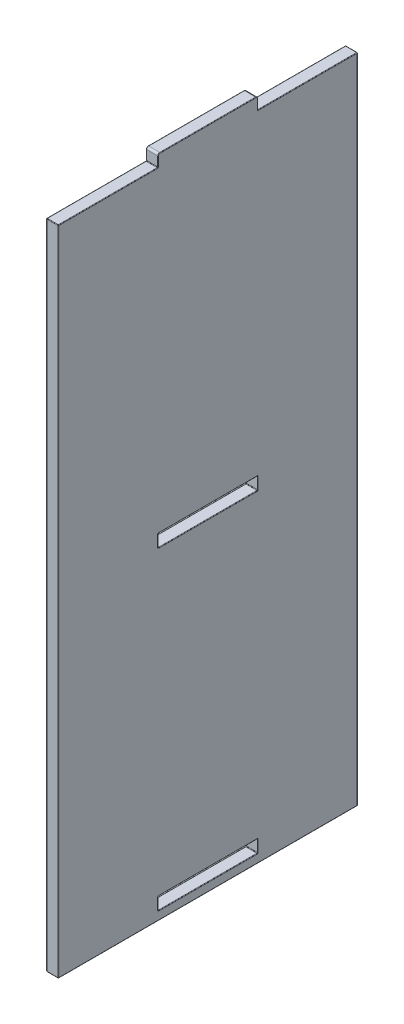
ISO-10303-21;
HEADER;
FILE_DESCRIPTION(('STEP AP214'),'2;1');
FILE_NAME('part.step','',(''),(''),'','','');
FILE_SCHEMA(('AUTOMOTIVE_DESIGN { 1 0 10303 214 1 1 1 1 }'));
ENDSEC;
DATA;
#1=APPLICATION_CONTEXT('core data for automotive mechanical design processes');
#2=APPLICATION_PROTOCOL_DEFINITION('international standard','automotive_design',2000,#1);
#3=PRODUCT_CONTEXT('',#1,'mechanical');
#4=PRODUCT('Part','Part','',(#3));
#5=PRODUCT_RELATED_PRODUCT_CATEGORY('part','',(#4));
#6=PRODUCT_DEFINITION_FORMATION('','',#4);
#7=PRODUCT_DEFINITION_CONTEXT('part definition',#1,'design');
#8=PRODUCT_DEFINITION('design','',#6,#7);
#9=PRODUCT_DEFINITION_SHAPE('','',#8);
#10=(LENGTH_UNIT() NAMED_UNIT(*) SI_UNIT(.MILLI.,.METRE.));
#11=(NAMED_UNIT(*) PLANE_ANGLE_UNIT() SI_UNIT($,.RADIAN.));
#12=(NAMED_UNIT(*) SI_UNIT($,.STERADIAN.) SOLID_ANGLE_UNIT());
#13=UNCERTAINTY_MEASURE_WITH_UNIT(LENGTH_MEASURE(1.E-05),#10,'distance_accuracy_value','');
#14=(GEOMETRIC_REPRESENTATION_CONTEXT(3) GLOBAL_UNCERTAINTY_ASSIGNED_CONTEXT((#13)) GLOBAL_UNIT_ASSIGNED_CONTEXT((#10,
#11,#12)) REPRESENTATION_CONTEXT('',''));
#15=CARTESIAN_POINT('',(0.,0.,0.));
#16=DIRECTION('',(0.,0.,1.));
#17=DIRECTION('',(1.,0.,0.));
#18=AXIS2_PLACEMENT_3D('',#15,#16,#17);
#19=CARTESIAN_POINT('',(12.,0.,0.));
#20=DIRECTION('',(1.,0.,0.));
#21=DIRECTION('',(0.,0.,-1.));
#22=AXIS2_PLACEMENT_3D('',#19,#20,#21);
#23=PLANE('',#22);
#24=CARTESIAN_POINT('',(12.,-317.75,-49.5000000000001));
#25=DIRECTION('',(1.,0.,0.));
#26=DIRECTION('',(0.,0.,-1.));
#27=AXIS2_PLACEMENT_3D('',#24,#25,#26);
#28=CIRCLE('',#27,1.);
#29=CARTESIAN_POINT('',(12.,-318.75,-49.5000000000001));
#30=VERTEX_POINT('',#29);
#31=CARTESIAN_POINT('',(12.,-317.75,-50.5000000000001));
#32=VERTEX_POINT('',#31);
#33=EDGE_CURVE('E708',#30,#32,#28,.T.);
#34=ORIENTED_EDGE('',*,*,#33,.F.);
#35=DIRECTION('',(0.,0.,-1.));
#36=VECTOR('',#35,1.);
#37=CARTESIAN_POINT('',(12.,-318.75,0.));
#38=LINE('',#37,#36);
#39=CARTESIAN_POINT('',(12.,-318.75,49.4999999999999));
#40=VERTEX_POINT('',#39);
#41=EDGE_CURVE('E716',#30,#40,#38,.F.);
#42=ORIENTED_EDGE('',*,*,#41,.T.);
#43=CARTESIAN_POINT('',(12.,-317.75,49.4999999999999));
#44=DIRECTION('',(1.,0.,0.));
#45=DIRECTION('',(0.,0.,-1.));
#46=AXIS2_PLACEMENT_3D('',#43,#44,#45);
#47=CIRCLE('',#46,1.);
#48=CARTESIAN_POINT('',(12.,-317.75,50.4999999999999));
#49=VERTEX_POINT('',#48);
#50=EDGE_CURVE('E712',#49,#40,#47,.T.);
#51=ORIENTED_EDGE('',*,*,#50,.F.);
#52=DIRECTION('',(0.,-1.,0.));
#53=VECTOR('',#52,1.);
#54=CARTESIAN_POINT('',(12.,0.,50.5000000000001));
#55=LINE('',#54,#53);
#56=CARTESIAN_POINT('',(12.,-306.25,50.4999999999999));
#57=VERTEX_POINT('',#56);
#58=EDGE_CURVE('E704',#49,#57,#55,.F.);
#59=ORIENTED_EDGE('',*,*,#58,.T.);
#60=CARTESIAN_POINT('',(12.,-306.25,49.4999999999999));
#61=DIRECTION('',(1.,0.,0.));
#62=DIRECTION('',(0.,0.,-1.));
#63=AXIS2_PLACEMENT_3D('',#60,#61,#62);
#64=CIRCLE('',#63,1.);
#65=CARTESIAN_POINT('',(12.,-305.25,49.4999999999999));
#66=VERTEX_POINT('',#65);
#67=EDGE_CURVE('E700',#66,#57,#64,.T.);
#68=ORIENTED_EDGE('',*,*,#67,.F.);
#69=DIRECTION('',(0.,0.,1.));
#70=VECTOR('',#69,1.);
#71=CARTESIAN_POINT('',(12.,-305.25,0.));
#72=LINE('',#71,#70);
#73=CARTESIAN_POINT('',(12.,-305.25,-49.5000000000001));
#74=VERTEX_POINT('',#73);
#75=EDGE_CURVE('E694',#66,#74,#72,.F.);
#76=ORIENTED_EDGE('',*,*,#75,.T.);
#77=CARTESIAN_POINT('',(12.,-306.25,-49.5000000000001));
#78=DIRECTION('',(1.,0.,0.));
#79=DIRECTION('',(0.,0.,-1.));
#80=AXIS2_PLACEMENT_3D('',#77,#78,#79);
#81=CIRCLE('',#80,1.);
#82=CARTESIAN_POINT('',(12.,-306.25,-50.5000000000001));
#83=VERTEX_POINT('',#82);
#84=EDGE_CURVE('E690',#83,#74,#81,.T.);
#85=ORIENTED_EDGE('',*,*,#84,.F.);
#86=DIRECTION('',(0.,1.,0.));
#87=VECTOR('',#86,1.);
#88=CARTESIAN_POINT('',(12.,0.,-50.5000000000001));
#89=LINE('',#88,#87);
#90=EDGE_CURVE('E697',#83,#32,#89,.F.);
#91=ORIENTED_EDGE('',*,*,#90,.T.);
#92=EDGE_LOOP('',(#34,#42,#51,#59,#68,#76,#85,#91));
#93=FACE_BOUND('',#92,.T.);
#94=CARTESIAN_POINT('',(12.,-2.75,-49.5));
#95=DIRECTION('',(1.,0.,0.));
#96=DIRECTION('',(0.,0.,-1.));
#97=AXIS2_PLACEMENT_3D('',#94,#95,#96);
#98=CIRCLE('',#97,1.);
#99=CARTESIAN_POINT('',(12.,-3.75,-49.5));
#100=VERTEX_POINT('',#99);
#101=CARTESIAN_POINT('',(12.,-2.75,-50.5));
#102=VERTEX_POINT('',#101);
#103=EDGE_CURVE('E679',#100,#102,#98,.T.);
#104=ORIENTED_EDGE('',*,*,#103,.F.);
#105=DIRECTION('',(0.,0.,-1.));
#106=VECTOR('',#105,1.);
#107=CARTESIAN_POINT('',(12.,-3.75,0.));
#108=LINE('',#107,#106);
#109=CARTESIAN_POINT('',(12.,-3.75,49.5));
#110=VERTEX_POINT('',#109);
#111=EDGE_CURVE('E687',#100,#110,#108,.F.);
#112=ORIENTED_EDGE('',*,*,#111,.T.);
#113=CARTESIAN_POINT('',(12.,-2.75,49.5));
#114=DIRECTION('',(1.,0.,0.));
#115=DIRECTION('',(0.,0.,-1.));
#116=AXIS2_PLACEMENT_3D('',#113,#114,#115);
#117=CIRCLE('',#116,1.);
#118=CARTESIAN_POINT('',(12.,-2.75,50.5));
#119=VERTEX_POINT('',#118);
#120=EDGE_CURVE('E683',#119,#110,#117,.T.);
#121=ORIENTED_EDGE('',*,*,#120,.F.);
#122=DIRECTION('',(0.,-1.,0.));
#123=VECTOR('',#122,1.);
#124=CARTESIAN_POINT('',(12.,0.,50.5));
#125=LINE('',#124,#123);
#126=CARTESIAN_POINT('',(12.,8.75,50.5));
#127=VERTEX_POINT('',#126);
#128=EDGE_CURVE('E675',#119,#127,#125,.F.);
#129=ORIENTED_EDGE('',*,*,#128,.T.);
#130=CARTESIAN_POINT('',(12.,8.75,49.5));
#131=DIRECTION('',(1.,0.,0.));
#132=DIRECTION('',(0.,0.,-1.));
#133=AXIS2_PLACEMENT_3D('',#130,#131,#132);
#134=CIRCLE('',#133,1.);
#135=CARTESIAN_POINT('',(12.,9.75000000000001,49.5));
#136=VERTEX_POINT('',#135);
#137=EDGE_CURVE('E672',#136,#127,#134,.T.);
#138=ORIENTED_EDGE('',*,*,#137,.F.);
#139=DIRECTION('',(0.,0.,1.));
#140=VECTOR('',#139,1.);
#141=CARTESIAN_POINT('',(12.,9.75000000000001,0.));
#142=LINE('',#141,#140);
#143=CARTESIAN_POINT('',(12.,9.75000000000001,-49.5));
#144=VERTEX_POINT('',#143);
#145=EDGE_CURVE('E666',#136,#144,#142,.F.);
#146=ORIENTED_EDGE('',*,*,#145,.T.);
#147=CARTESIAN_POINT('',(12.,8.75,-49.5));
#148=DIRECTION('',(1.,0.,0.));
#149=DIRECTION('',(0.,0.,-1.));
#150=AXIS2_PLACEMENT_3D('',#147,#148,#149);
#151=CIRCLE('',#150,1.);
#152=CARTESIAN_POINT('',(12.,8.75,-50.5));
#153=VERTEX_POINT('',#152);
#154=EDGE_CURVE('E662',#153,#144,#151,.T.);
#155=ORIENTED_EDGE('',*,*,#154,.F.);
#156=DIRECTION('',(0.,1.,0.));
#157=VECTOR('',#156,1.);
#158=CARTESIAN_POINT('',(12.,0.,-50.5));
#159=LINE('',#158,#157);
#160=EDGE_CURVE('E669',#153,#102,#159,.F.);
#161=ORIENTED_EDGE('',*,*,#160,.T.);
#162=EDGE_LOOP('',(#104,#112,#121,#129,#138,#146,#155,#161));
#163=FACE_BOUND('',#162,.T.);
#164=DIRECTION('',(0.,1.,0.));
#165=VECTOR('',#164,1.);
#166=CARTESIAN_POINT('',(12.,337.,-49.5));
#167=LINE('',#166,#165);
#168=CARTESIAN_POINT('',(12.,327.5,-49.5));
#169=VERTEX_POINT('',#168);
#170=CARTESIAN_POINT('',(12.,337.,-49.5));
#171=VERTEX_POINT('',#170);
#172=EDGE_CURVE('E656',#169,#171,#167,.T.);
#173=ORIENTED_EDGE('',*,*,#172,.T.);
#174=CARTESIAN_POINT('',(12.,337.,-48.));
#175=DIRECTION('',(1.,0.,0.));
#176=DIRECTION('',(0.,0.,-1.));
#177=AXIS2_PLACEMENT_3D('',#174,#175,#176);
#178=CIRCLE('',#177,1.5);
#179=CARTESIAN_POINT('',(12.,338.5,-48.));
#180=VERTEX_POINT('',#179);
#181=EDGE_CURVE('E659',#171,#180,#178,.T.);
#182=ORIENTED_EDGE('',*,*,#181,.T.);
#183=DIRECTION('',(0.,0.,1.));
#184=VECTOR('',#183,1.);
#185=CARTESIAN_POINT('',(12.,338.5,48.));
#186=LINE('',#185,#184);
#187=CARTESIAN_POINT('',(12.,338.5,48.));
#188=VERTEX_POINT('',#187);
#189=EDGE_CURVE('E448',#180,#188,#186,.T.);
#190=ORIENTED_EDGE('',*,*,#189,.T.);
#191=CARTESIAN_POINT('',(12.,337.,48.));
#192=DIRECTION('',(1.,0.,0.));
#193=DIRECTION('',(0.,0.,-1.));
#194=AXIS2_PLACEMENT_3D('',#191,#192,#193);
#195=CIRCLE('',#194,1.5);
#196=CARTESIAN_POINT('',(12.,337.,49.5));
#197=VERTEX_POINT('',#196);
#198=EDGE_CURVE('E644',#188,#197,#195,.T.);
#199=ORIENTED_EDGE('',*,*,#198,.T.);
#200=DIRECTION('',(0.,-1.,0.));
#201=VECTOR('',#200,1.);
#202=CARTESIAN_POINT('',(12.,327.,49.5));
#203=LINE('',#202,#201);
#204=CARTESIAN_POINT('',(12.,327.5,49.5));
#205=VERTEX_POINT('',#204);
#206=EDGE_CURVE('E631',#197,#205,#203,.T.);
#207=ORIENTED_EDGE('',*,*,#206,.T.);
#208=CARTESIAN_POINT('',(12.,327.5,50.5));
#209=DIRECTION('',(1.,0.,0.));
#210=DIRECTION('',(0.,0.,-1.));
#211=AXIS2_PLACEMENT_3D('',#208,#209,#210);
#212=CIRCLE('',#211,1.);
#213=CARTESIAN_POINT('',(12.,326.5,50.5));
#214=VERTEX_POINT('',#213);
#215=EDGE_CURVE('E627',#214,#205,#212,.T.);
#216=ORIENTED_EDGE('',*,*,#215,.F.);
#217=DIRECTION('',(0.,0.,1.));
#218=VECTOR('',#217,1.);
#219=CARTESIAN_POINT('',(12.,326.5,150.));
#220=LINE('',#219,#218);
#221=CARTESIAN_POINT('',(12.,326.5,149.5));
#222=VERTEX_POINT('',#221);
#223=EDGE_CURVE('E624',#214,#222,#220,.T.);
#224=ORIENTED_EDGE('',*,*,#223,.T.);
#225=DIRECTION('',(0.,-1.,0.));
#226=VECTOR('',#225,1.);
#227=CARTESIAN_POINT('',(12.,-327.,149.5));
#228=LINE('',#227,#226);
#229=CARTESIAN_POINT('',(12.,-326.5,149.5));
#230=VERTEX_POINT('',#229);
#231=EDGE_CURVE('E634',#222,#230,#228,.T.);
#232=ORIENTED_EDGE('',*,*,#231,.T.);
#233=DIRECTION('',(0.,0.,-1.));
#234=VECTOR('',#233,1.);
#235=CARTESIAN_POINT('',(12.,-326.5,-150.));
#236=LINE('',#235,#234);
#237=CARTESIAN_POINT('',(12.,-326.5,-149.5));
#238=VERTEX_POINT('',#237);
#239=EDGE_CURVE('E637',#230,#238,#236,.T.);
#240=ORIENTED_EDGE('',*,*,#239,.T.);
#241=DIRECTION('',(0.,1.,0.));
#242=VECTOR('',#241,1.);
#243=CARTESIAN_POINT('',(12.,327.,-149.5));
#244=LINE('',#243,#242);
#245=CARTESIAN_POINT('',(12.,326.5,-149.5));
#246=VERTEX_POINT('',#245);
#247=EDGE_CURVE('E641',#238,#246,#244,.T.);
#248=ORIENTED_EDGE('',*,*,#247,.T.);
#249=DIRECTION('',(0.,0.,1.));
#250=VECTOR('',#249,1.);
#251=CARTESIAN_POINT('',(12.,326.5,-50.));
#252=LINE('',#251,#250);
#253=CARTESIAN_POINT('',(12.,326.5,-50.5));
#254=VERTEX_POINT('',#253);
#255=EDGE_CURVE('E647',#246,#254,#252,.T.);
#256=ORIENTED_EDGE('',*,*,#255,.T.);
#257=CARTESIAN_POINT('',(12.,327.5,-50.5));
#258=DIRECTION('',(1.,0.,0.));
#259=DIRECTION('',(0.,0.,-1.));
#260=AXIS2_PLACEMENT_3D('',#257,#258,#259);
#261=CIRCLE('',#260,1.);
#262=EDGE_CURVE('E652',#169,#254,#261,.T.);
#263=ORIENTED_EDGE('',*,*,#262,.F.);
#264=EDGE_LOOP('',(#173,#182,#190,#199,#207,#216,#224,#232,#240,#248,#256,#263));
#265=FACE_BOUND('',#264,.T.);
#266=ADVANCED_FACE('F38',(#93,#163,#265),#23,.T.);
#267=CARTESIAN_POINT('',(0.,0.,0.));
#268=DIRECTION('',(1.,0.,0.));
#269=DIRECTION('',(0.,0.,-1.));
#270=AXIS2_PLACEMENT_3D('',#267,#268,#269);
#271=PLANE('',#270);
#272=CARTESIAN_POINT('',(0.,-306.25,49.4999999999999));
#273=DIRECTION('',(1.,0.,0.));
#274=DIRECTION('',(0.,0.,-1.));
#275=AXIS2_PLACEMENT_3D('',#272,#273,#274);
#276=CIRCLE('',#275,1.);
#277=CARTESIAN_POINT('',(0.,-306.25,50.4999999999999));
#278=VERTEX_POINT('',#277);
#279=CARTESIAN_POINT('',(0.,-305.25,49.4999999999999));
#280=VERTEX_POINT('',#279);
#281=EDGE_CURVE('E1195',#278,#280,#276,.F.);
#282=ORIENTED_EDGE('',*,*,#281,.F.);
#283=DIRECTION('',(0.,-1.,0.));
#284=VECTOR('',#283,1.);
#285=CARTESIAN_POINT('',(0.,-318.25,50.4999999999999));
#286=LINE('',#285,#284);
#287=CARTESIAN_POINT('',(0.,-317.75,50.4999999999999));
#288=VERTEX_POINT('',#287);
#289=EDGE_CURVE('E461',#278,#288,#286,.T.);
#290=ORIENTED_EDGE('',*,*,#289,.T.);
#291=CARTESIAN_POINT('',(0.,-317.75,49.4999999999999));
#292=DIRECTION('',(1.,0.,0.));
#293=DIRECTION('',(0.,0.,-1.));
#294=AXIS2_PLACEMENT_3D('',#291,#292,#293);
#295=CIRCLE('',#294,1.);
#296=CARTESIAN_POINT('',(0.,-318.75,49.4999999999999));
#297=VERTEX_POINT('',#296);
#298=EDGE_CURVE('E467',#297,#288,#295,.F.);
#299=ORIENTED_EDGE('',*,*,#298,.F.);
#300=DIRECTION('',(0.,0.,-1.));
#301=VECTOR('',#300,1.);
#302=CARTESIAN_POINT('',(0.,-318.75,-50.0000000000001));
#303=LINE('',#302,#301);
#304=CARTESIAN_POINT('',(0.,-318.75,-49.5000000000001));
#305=VERTEX_POINT('',#304);
#306=EDGE_CURVE('E1185',#297,#305,#303,.T.);
#307=ORIENTED_EDGE('',*,*,#306,.T.);
#308=CARTESIAN_POINT('',(0.,-317.75,-49.5000000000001));
#309=DIRECTION('',(1.,0.,0.));
#310=DIRECTION('',(0.,0.,-1.));
#311=AXIS2_PLACEMENT_3D('',#308,#309,#310);
#312=CIRCLE('',#311,1.);
#313=CARTESIAN_POINT('',(0.,-317.75,-50.5000000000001));
#314=VERTEX_POINT('',#313);
#315=EDGE_CURVE('E1201',#314,#305,#312,.F.);
#316=ORIENTED_EDGE('',*,*,#315,.F.);
#317=DIRECTION('',(0.,1.,0.));
#318=VECTOR('',#317,1.);
#319=CARTESIAN_POINT('',(0.,-305.75,-50.5000000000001));
#320=LINE('',#319,#318);
#321=CARTESIAN_POINT('',(0.,-306.25,-50.5000000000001));
#322=VERTEX_POINT('',#321);
#323=EDGE_CURVE('E1208',#314,#322,#320,.T.);
#324=ORIENTED_EDGE('',*,*,#323,.T.);
#325=CARTESIAN_POINT('',(0.,-306.25,-49.5000000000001));
#326=DIRECTION('',(1.,0.,0.));
#327=DIRECTION('',(0.,0.,-1.));
#328=AXIS2_PLACEMENT_3D('',#325,#326,#327);
#329=CIRCLE('',#328,1.);
#330=CARTESIAN_POINT('',(0.,-305.25,-49.5000000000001));
#331=VERTEX_POINT('',#330);
#332=EDGE_CURVE('E1150',#331,#322,#329,.F.);
#333=ORIENTED_EDGE('',*,*,#332,.F.);
#334=DIRECTION('',(0.,0.,1.));
#335=VECTOR('',#334,1.);
#336=CARTESIAN_POINT('',(0.,-305.25,49.9999999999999));
#337=LINE('',#336,#335);
#338=EDGE_CURVE('E1145',#331,#280,#337,.T.);
#339=ORIENTED_EDGE('',*,*,#338,.T.);
#340=EDGE_LOOP('',(#282,#290,#299,#307,#316,#324,#333,#339));
#341=FACE_BOUND('',#340,.T.);
#342=CARTESIAN_POINT('',(0.,8.75,49.5));
#343=DIRECTION('',(1.,0.,0.));
#344=DIRECTION('',(0.,0.,-1.));
#345=AXIS2_PLACEMENT_3D('',#342,#343,#344);
#346=CIRCLE('',#345,1.);
#347=CARTESIAN_POINT('',(0.,8.75,50.5));
#348=VERTEX_POINT('',#347);
#349=CARTESIAN_POINT('',(0.,9.75000000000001,49.5));
#350=VERTEX_POINT('',#349);
#351=EDGE_CURVE('E1220',#348,#350,#346,.F.);
#352=ORIENTED_EDGE('',*,*,#351,.F.);
#353=DIRECTION('',(0.,-1.,0.));
#354=VECTOR('',#353,1.);
#355=CARTESIAN_POINT('',(0.,-3.25,50.5));
#356=LINE('',#355,#354);
#357=CARTESIAN_POINT('',(0.,-2.75,50.5));
#358=VERTEX_POINT('',#357);
#359=EDGE_CURVE('E1213',#348,#358,#356,.T.);
#360=ORIENTED_EDGE('',*,*,#359,.T.);
#361=CARTESIAN_POINT('',(0.,-2.75,49.5));
#362=DIRECTION('',(1.,0.,0.));
#363=DIRECTION('',(0.,0.,-1.));
#364=AXIS2_PLACEMENT_3D('',#361,#362,#363);
#365=CIRCLE('',#364,1.);
#366=CARTESIAN_POINT('',(0.,-3.75,49.5));
#367=VERTEX_POINT('',#366);
#368=EDGE_CURVE('E1216',#367,#358,#365,.F.);
#369=ORIENTED_EDGE('',*,*,#368,.F.);
#370=DIRECTION('',(0.,0.,-1.));
#371=VECTOR('',#370,1.);
#372=CARTESIAN_POINT('',(0.,-3.75,-50.));
#373=LINE('',#372,#371);
#374=CARTESIAN_POINT('',(0.,-3.75,-49.5));
#375=VERTEX_POINT('',#374);
#376=EDGE_CURVE('E1224',#367,#375,#373,.T.);
#377=ORIENTED_EDGE('',*,*,#376,.T.);
#378=CARTESIAN_POINT('',(0.,-2.75,-49.5));
#379=DIRECTION('',(1.,0.,0.));
#380=DIRECTION('',(0.,0.,-1.));
#381=AXIS2_PLACEMENT_3D('',#378,#379,#380);
#382=CIRCLE('',#381,1.);
#383=CARTESIAN_POINT('',(0.,-2.75,-50.5));
#384=VERTEX_POINT('',#383);
#385=EDGE_CURVE('E1228',#384,#375,#382,.F.);
#386=ORIENTED_EDGE('',*,*,#385,.F.);
#387=DIRECTION('',(0.,1.,0.));
#388=VECTOR('',#387,1.);
#389=CARTESIAN_POINT('',(0.,9.25000000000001,-50.5));
#390=LINE('',#389,#388);
#391=CARTESIAN_POINT('',(0.,8.75,-50.5));
#392=VERTEX_POINT('',#391);
#393=EDGE_CURVE('E1235',#384,#392,#390,.T.);
#394=ORIENTED_EDGE('',*,*,#393,.T.);
#395=CARTESIAN_POINT('',(0.,8.75,-49.5));
#396=DIRECTION('',(1.,0.,0.));
#397=DIRECTION('',(0.,0.,-1.));
#398=AXIS2_PLACEMENT_3D('',#395,#396,#397);
#399=CIRCLE('',#398,1.);
#400=CARTESIAN_POINT('',(0.,9.75000000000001,-49.5));
#401=VERTEX_POINT('',#400);
#402=EDGE_CURVE('E1238',#401,#392,#399,.F.);
#403=ORIENTED_EDGE('',*,*,#402,.F.);
#404=DIRECTION('',(0.,0.,1.));
#405=VECTOR('',#404,1.);
#406=CARTESIAN_POINT('',(0.,9.75000000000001,50.));
#407=LINE('',#406,#405);
#408=EDGE_CURVE('E1232',#401,#350,#407,.T.);
#409=ORIENTED_EDGE('',*,*,#408,.T.);
#410=EDGE_LOOP('',(#352,#360,#369,#377,#386,#394,#403,#409));
#411=FACE_BOUND('',#410,.T.);
#412=CARTESIAN_POINT('',(0.,337.,-48.));
#413=DIRECTION('',(1.,0.,0.));
#414=DIRECTION('',(0.,0.,-1.));
#415=AXIS2_PLACEMENT_3D('',#412,#413,#414);
#416=CIRCLE('',#415,1.5);
#417=CARTESIAN_POINT('',(0.,338.5,-48.));
#418=VERTEX_POINT('',#417);
#419=CARTESIAN_POINT('',(0.,337.,-49.5));
#420=VERTEX_POINT('',#419);
#421=EDGE_CURVE('E1252',#418,#420,#416,.F.);
#422=ORIENTED_EDGE('',*,*,#421,.T.);
#423=DIRECTION('',(0.,1.,0.));
#424=VECTOR('',#423,1.);
#425=CARTESIAN_POINT('',(0.,0.,-49.5));
#426=LINE('',#425,#424);
#427=CARTESIAN_POINT('',(0.,327.5,-49.5));
#428=VERTEX_POINT('',#427);
#429=EDGE_CURVE('E1242',#420,#428,#426,.F.);
#430=ORIENTED_EDGE('',*,*,#429,.T.);
#431=CARTESIAN_POINT('',(0.,327.5,-50.5));
#432=DIRECTION('',(1.,0.,0.));
#433=DIRECTION('',(0.,0.,-1.));
#434=AXIS2_PLACEMENT_3D('',#431,#432,#433);
#435=CIRCLE('',#434,1.);
#436=CARTESIAN_POINT('',(0.,326.5,-50.5));
#437=VERTEX_POINT('',#436);
#438=EDGE_CURVE('E1245',#437,#428,#435,.F.);
#439=ORIENTED_EDGE('',*,*,#438,.F.);
#440=DIRECTION('',(0.,0.,1.));
#441=VECTOR('',#440,1.);
#442=CARTESIAN_POINT('',(0.,326.5,-3.62487817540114E-13));
#443=LINE('',#442,#441);
#444=CARTESIAN_POINT('',(0.,326.5,-149.5));
#445=VERTEX_POINT('',#444);
#446=EDGE_CURVE('E1249',#437,#445,#443,.F.);
#447=ORIENTED_EDGE('',*,*,#446,.T.);
#448=DIRECTION('',(0.,1.,0.));
#449=VECTOR('',#448,1.);
#450=CARTESIAN_POINT('',(0.,0.,-149.5));
#451=LINE('',#450,#449);
#452=CARTESIAN_POINT('',(0.,-326.5,-149.5));
#453=VERTEX_POINT('',#452);
#454=EDGE_CURVE('E1255',#445,#453,#451,.F.);
#455=ORIENTED_EDGE('',*,*,#454,.T.);
#456=DIRECTION('',(0.,0.,-1.));
#457=VECTOR('',#456,1.);
#458=CARTESIAN_POINT('',(0.,-326.5,0.));
#459=LINE('',#458,#457);
#460=CARTESIAN_POINT('',(0.,-326.5,149.5));
#461=VERTEX_POINT('',#460);
#462=EDGE_CURVE('E1268',#453,#461,#459,.F.);
#463=ORIENTED_EDGE('',*,*,#462,.T.);
#464=DIRECTION('',(0.,-1.,0.));
#465=VECTOR('',#464,1.);
#466=CARTESIAN_POINT('',(0.,0.,149.5));
#467=LINE('',#466,#465);
#468=CARTESIAN_POINT('',(0.,326.5,149.5));
#469=VERTEX_POINT('',#468);
#470=EDGE_CURVE('E1271',#461,#469,#467,.F.);
#471=ORIENTED_EDGE('',*,*,#470,.T.);
#472=DIRECTION('',(0.,0.,1.));
#473=VECTOR('',#472,1.);
#474=CARTESIAN_POINT('',(0.,326.5,0.));
#475=LINE('',#474,#473);
#476=CARTESIAN_POINT('',(0.,326.5,50.5));
#477=VERTEX_POINT('',#476);
#478=EDGE_CURVE('E1274',#469,#477,#475,.F.);
#479=ORIENTED_EDGE('',*,*,#478,.T.);
#480=CARTESIAN_POINT('',(0.,327.5,50.5));
#481=DIRECTION('',(1.,0.,0.));
#482=DIRECTION('',(0.,0.,-1.));
#483=AXIS2_PLACEMENT_3D('',#480,#481,#482);
#484=CIRCLE('',#483,1.);
#485=CARTESIAN_POINT('',(0.,327.5,49.5));
#486=VERTEX_POINT('',#485);
#487=EDGE_CURVE('E1277',#486,#477,#484,.F.);
#488=ORIENTED_EDGE('',*,*,#487,.F.);
#489=DIRECTION('',(0.,-1.,0.));
#490=VECTOR('',#489,1.);
#491=CARTESIAN_POINT('',(0.,0.,49.5));
#492=LINE('',#491,#490);
#493=CARTESIAN_POINT('',(0.,337.,49.5));
#494=VERTEX_POINT('',#493);
#495=EDGE_CURVE('E1265',#486,#494,#492,.F.);
#496=ORIENTED_EDGE('',*,*,#495,.T.);
#497=CARTESIAN_POINT('',(0.,337.,48.));
#498=DIRECTION('',(1.,0.,0.));
#499=DIRECTION('',(0.,0.,-1.));
#500=AXIS2_PLACEMENT_3D('',#497,#498,#499);
#501=CIRCLE('',#500,1.5);
#502=CARTESIAN_POINT('',(0.,338.5,48.));
#503=VERTEX_POINT('',#502);
#504=EDGE_CURVE('E1262',#494,#503,#501,.F.);
#505=ORIENTED_EDGE('',*,*,#504,.T.);
#506=DIRECTION('',(0.,0.,1.));
#507=VECTOR('',#506,1.);
#508=CARTESIAN_POINT('',(0.,338.5,3.75810493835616E-13));
#509=LINE('',#508,#507);
#510=EDGE_CURVE('E1258',#503,#418,#509,.F.);
#511=ORIENTED_EDGE('',*,*,#510,.T.);
#512=EDGE_LOOP('',(#422,#430,#439,#447,#455,#463,#471,#479,#488,#496,#505,#511));
#513=FACE_BOUND('',#512,.T.);
#514=ADVANCED_FACE('F1339',(#341,#411,#513),#271,.F.);
#515=CARTESIAN_POINT('',(12.,327.,-150.));
#516=DIRECTION('',(0.,0.,1.));
#517=DIRECTION('',(0.,-1.,0.));
#518=AXIS2_PLACEMENT_3D('',#515,#516,#517);
#519=PLANE('',#518);
#520=DIRECTION('',(0.,1.,0.));
#521=VECTOR('',#520,1.);
#522=CARTESIAN_POINT('',(11.5,-327.,-150.));
#523=LINE('',#522,#521);
#524=CARTESIAN_POINT('',(11.5,326.5,-150.));
#525=VERTEX_POINT('',#524);
#526=CARTESIAN_POINT('',(11.5,-326.5,-150.));
#527=VERTEX_POINT('',#526);
#528=EDGE_CURVE('E725',#525,#527,#523,.F.);
#529=ORIENTED_EDGE('',*,*,#528,.T.);
#530=DIRECTION('',(-1.,0.,0.));
#531=VECTOR('',#530,1.);
#532=CARTESIAN_POINT('',(12.,-326.5,-150.));
#533=LINE('',#532,#531);
#534=CARTESIAN_POINT('',(0.5,-326.5,-150.));
#535=VERTEX_POINT('',#534);
#536=EDGE_CURVE('E728',#527,#535,#533,.T.);
#537=ORIENTED_EDGE('',*,*,#536,.T.);
#538=DIRECTION('',(0.,1.,0.));
#539=VECTOR('',#538,1.);
#540=CARTESIAN_POINT('',(0.5,327.,-150.));
#541=LINE('',#540,#539);
#542=CARTESIAN_POINT('',(0.5,326.5,-150.));
#543=VERTEX_POINT('',#542);
#544=EDGE_CURVE('E722',#535,#543,#541,.T.);
#545=ORIENTED_EDGE('',*,*,#544,.T.);
#546=DIRECTION('',(-1.,0.,0.));
#547=VECTOR('',#546,1.);
#548=CARTESIAN_POINT('',(12.,326.5,-150.));
#549=LINE('',#548,#547);
#550=EDGE_CURVE('E719',#543,#525,#549,.F.);
#551=ORIENTED_EDGE('',*,*,#550,.T.);
#552=EDGE_LOOP('',(#529,#537,#545,#551));
#553=FACE_BOUND('',#552,.T.);
#554=ADVANCED_FACE('F1369',(#553),#519,.F.);
#555=CARTESIAN_POINT('',(12.,327.,-50.));
#556=DIRECTION('',(0.,-1.,0.));
#557=DIRECTION('',(0.,0.,-1.));
#558=AXIS2_PLACEMENT_3D('',#555,#556,#557);
#559=PLANE('',#558);
#560=DIRECTION('',(0.,0.,1.));
#561=VECTOR('',#560,1.);
#562=CARTESIAN_POINT('',(11.5,327.,-150.));
#563=LINE('',#562,#561);
#564=CARTESIAN_POINT('',(11.5,327.,-50.5));
#565=VERTEX_POINT('',#564);
#566=CARTESIAN_POINT('',(11.5,327.,-149.5));
#567=VERTEX_POINT('',#566);
#568=EDGE_CURVE('E738',#565,#567,#563,.F.);
#569=ORIENTED_EDGE('',*,*,#568,.T.);
#570=DIRECTION('',(-1.,0.,0.));
#571=VECTOR('',#570,1.);
#572=CARTESIAN_POINT('',(12.,327.,-149.5));
#573=LINE('',#572,#571);
#574=CARTESIAN_POINT('',(0.5,327.,-149.5));
#575=VERTEX_POINT('',#574);
#576=EDGE_CURVE('E741',#567,#575,#573,.T.);
#577=ORIENTED_EDGE('',*,*,#576,.T.);
#578=DIRECTION('',(0.,0.,1.));
#579=VECTOR('',#578,1.);
#580=CARTESIAN_POINT('',(0.5,327.,-50.));
#581=LINE('',#580,#579);
#582=CARTESIAN_POINT('',(0.5,327.,-50.5));
#583=VERTEX_POINT('',#582);
#584=EDGE_CURVE('E732',#575,#583,#581,.T.);
#585=ORIENTED_EDGE('',*,*,#584,.T.);
#586=DIRECTION('',(-1.,0.,0.));
#587=VECTOR('',#586,1.);
#588=CARTESIAN_POINT('',(12.,327.,-50.5));
#589=LINE('',#588,#587);
#590=EDGE_CURVE('E735',#583,#565,#589,.F.);
#591=ORIENTED_EDGE('',*,*,#590,.T.);
#592=EDGE_LOOP('',(#569,#577,#585,#591));
#593=FACE_BOUND('',#592,.T.);
#594=ADVANCED_FACE('F1353',(#593),#559,.F.);
#595=CARTESIAN_POINT('',(12.,339.,-50.));
#596=DIRECTION('',(0.,0.,1.));
#597=DIRECTION('',(1.,0.,0.));
#598=AXIS2_PLACEMENT_3D('',#595,#596,#597);
#599=PLANE('',#598);
#600=DIRECTION('',(-1.,0.,0.));
#601=VECTOR('',#600,1.);
#602=CARTESIAN_POINT('',(0.,327.5,-50.));
#603=LINE('',#602,#601);
#604=CARTESIAN_POINT('',(11.5,327.5,-50.));
#605=VERTEX_POINT('',#604);
#606=CARTESIAN_POINT('',(0.5,327.5,-50.));
#607=VERTEX_POINT('',#606);
#608=EDGE_CURVE('E476',#605,#607,#603,.T.);
#609=ORIENTED_EDGE('',*,*,#608,.T.);
#610=DIRECTION('',(0.,1.,0.));
#611=VECTOR('',#610,1.);
#612=CARTESIAN_POINT('',(0.5,339.,-50.));
#613=LINE('',#612,#611);
#614=CARTESIAN_POINT('',(0.5,337.,-50.));
#615=VERTEX_POINT('',#614);
#616=EDGE_CURVE('E482',#607,#615,#613,.T.);
#617=ORIENTED_EDGE('',*,*,#616,.T.);
#618=DIRECTION('',(-1.,0.,0.));
#619=VECTOR('',#618,1.);
#620=CARTESIAN_POINT('',(12.,337.,-50.));
#621=LINE('',#620,#619);
#622=CARTESIAN_POINT('',(11.5,337.,-50.));
#623=VERTEX_POINT('',#622);
#624=EDGE_CURVE('E442',#615,#623,#621,.F.);
#625=ORIENTED_EDGE('',*,*,#624,.T.);
#626=DIRECTION('',(0.,1.,0.));
#627=VECTOR('',#626,1.);
#628=CARTESIAN_POINT('',(11.5,327.,-50.));
#629=LINE('',#628,#627);
#630=EDGE_CURVE('E479',#623,#605,#629,.F.);
#631=ORIENTED_EDGE('',*,*,#630,.T.);
#632=EDGE_LOOP('',(#609,#617,#625,#631));
#633=FACE_BOUND('',#632,.T.);
#634=ADVANCED_FACE('F1290',(#633),#599,.F.);
#635=CARTESIAN_POINT('',(12.,339.,50.));
#636=DIRECTION('',(0.,-1.,0.));
#637=DIRECTION('',(0.,0.,-1.));
#638=AXIS2_PLACEMENT_3D('',#635,#636,#637);
#639=PLANE('',#638);
#640=DIRECTION('',(-1.,0.,0.));
#641=VECTOR('',#640,1.);
#642=CARTESIAN_POINT('',(12.,339.,-48.));
#643=LINE('',#642,#641);
#644=CARTESIAN_POINT('',(11.5,339.,-48.));
#645=VERTEX_POINT('',#644);
#646=CARTESIAN_POINT('',(0.5,339.,-48.));
#647=VERTEX_POINT('',#646);
#648=EDGE_CURVE('E421',#645,#647,#643,.T.);
#649=ORIENTED_EDGE('',*,*,#648,.T.);
#650=DIRECTION('',(0.,0.,1.));
#651=VECTOR('',#650,1.);
#652=CARTESIAN_POINT('',(0.5,339.,50.));
#653=LINE('',#652,#651);
#654=CARTESIAN_POINT('',(0.5,339.,48.));
#655=VERTEX_POINT('',#654);
#656=EDGE_CURVE('E430',#647,#655,#653,.T.);
#657=ORIENTED_EDGE('',*,*,#656,.T.);
#658=DIRECTION('',(-1.,0.,0.));
#659=VECTOR('',#658,1.);
#660=CARTESIAN_POINT('',(12.,339.,48.));
#661=LINE('',#660,#659);
#662=CARTESIAN_POINT('',(11.5,339.,48.));
#663=VERTEX_POINT('',#662);
#664=EDGE_CURVE('E424',#655,#663,#661,.F.);
#665=ORIENTED_EDGE('',*,*,#664,.T.);
#666=DIRECTION('',(0.,0.,1.));
#667=VECTOR('',#666,1.);
#668=CARTESIAN_POINT('',(11.5,339.,-48.));
#669=LINE('',#668,#667);
#670=EDGE_CURVE('E417',#663,#645,#669,.F.);
#671=ORIENTED_EDGE('',*,*,#670,.T.);
#672=EDGE_LOOP('',(#649,#657,#665,#671));
#673=FACE_BOUND('',#672,.T.);
#674=ADVANCED_FACE('F419',(#673),#639,.F.);
#675=CARTESIAN_POINT('',(12.,339.,50.));
#676=DIRECTION('',(0.,0.,-1.));
#677=DIRECTION('',(-1.,0.,0.));
#678=AXIS2_PLACEMENT_3D('',#675,#676,#677);
#679=PLANE('',#678);
#680=DIRECTION('',(-1.,0.,0.));
#681=VECTOR('',#680,1.);
#682=CARTESIAN_POINT('',(12.,337.,50.));
#683=LINE('',#682,#681);
#684=CARTESIAN_POINT('',(11.5,337.,50.));
#685=VERTEX_POINT('',#684);
#686=CARTESIAN_POINT('',(0.5,337.,50.));
#687=VERTEX_POINT('',#686);
#688=EDGE_CURVE('E431',#685,#687,#683,.T.);
#689=ORIENTED_EDGE('',*,*,#688,.T.);
#690=DIRECTION('',(0.,-1.,0.));
#691=VECTOR('',#690,1.);
#692=CARTESIAN_POINT('',(0.5,339.,50.));
#693=LINE('',#692,#691);
#694=CARTESIAN_POINT('',(0.5,327.5,50.));
#695=VERTEX_POINT('',#694);
#696=EDGE_CURVE('E491',#687,#695,#693,.T.);
#697=ORIENTED_EDGE('',*,*,#696,.T.);
#698=DIRECTION('',(-1.,0.,0.));
#699=VECTOR('',#698,1.);
#700=CARTESIAN_POINT('',(12.,327.5,50.));
#701=LINE('',#700,#699);
#702=CARTESIAN_POINT('',(11.5,327.5,50.));
#703=VERTEX_POINT('',#702);
#704=EDGE_CURVE('E485',#695,#703,#701,.F.);
#705=ORIENTED_EDGE('',*,*,#704,.T.);
#706=DIRECTION('',(0.,-1.,0.));
#707=VECTOR('',#706,1.);
#708=CARTESIAN_POINT('',(11.5,337.,50.));
#709=LINE('',#708,#707);
#710=EDGE_CURVE('E488',#703,#685,#709,.F.);
#711=ORIENTED_EDGE('',*,*,#710,.T.);
#712=EDGE_LOOP('',(#689,#697,#705,#711));
#713=FACE_BOUND('',#712,.T.);
#714=ADVANCED_FACE('F1448',(#713),#679,.F.);
#715=CARTESIAN_POINT('',(12.,327.,150.));
#716=DIRECTION('',(0.,-1.,0.));
#717=DIRECTION('',(0.,0.,-1.));
#718=AXIS2_PLACEMENT_3D('',#715,#716,#717);
#719=PLANE('',#718);
#720=DIRECTION('',(0.,0.,1.));
#721=VECTOR('',#720,1.);
#722=CARTESIAN_POINT('',(11.5,327.,50.));
#723=LINE('',#722,#721);
#724=CARTESIAN_POINT('',(11.5,327.,149.5));
#725=VERTEX_POINT('',#724);
#726=CARTESIAN_POINT('',(11.5,327.,50.5));
#727=VERTEX_POINT('',#726);
#728=EDGE_CURVE('E48',#725,#727,#723,.F.);
#729=ORIENTED_EDGE('',*,*,#728,.T.);
#730=DIRECTION('',(-1.,0.,0.));
#731=VECTOR('',#730,1.);
#732=CARTESIAN_POINT('',(0.,327.,50.5));
#733=LINE('',#732,#731);
#734=CARTESIAN_POINT('',(0.5,327.,50.5));
#735=VERTEX_POINT('',#734);
#736=EDGE_CURVE('E11',#727,#735,#733,.T.);
#737=ORIENTED_EDGE('',*,*,#736,.T.);
#738=DIRECTION('',(0.,0.,1.));
#739=VECTOR('',#738,1.);
#740=CARTESIAN_POINT('',(0.5,327.,150.));
#741=LINE('',#740,#739);
#742=CARTESIAN_POINT('',(0.5,327.,149.5));
#743=VERTEX_POINT('',#742);
#744=EDGE_CURVE('E745',#735,#743,#741,.T.);
#745=ORIENTED_EDGE('',*,*,#744,.T.);
#746=DIRECTION('',(-1.,0.,0.));
#747=VECTOR('',#746,1.);
#748=CARTESIAN_POINT('',(12.,327.,149.5));
#749=LINE('',#748,#747);
#750=EDGE_CURVE('E59',#743,#725,#749,.F.);
#751=ORIENTED_EDGE('',*,*,#750,.T.);
#752=EDGE_LOOP('',(#729,#737,#745,#751));
#753=FACE_BOUND('',#752,.T.);
#754=ADVANCED_FACE('F1444',(#753),#719,.F.);
#755=CARTESIAN_POINT('',(12.,327.,150.));
#756=DIRECTION('',(0.,0.,-1.));
#757=DIRECTION('',(0.,1.,0.));
#758=AXIS2_PLACEMENT_3D('',#755,#756,#757);
#759=PLANE('',#758);
#760=DIRECTION('',(0.,-1.,0.));
#761=VECTOR('',#760,1.);
#762=CARTESIAN_POINT('',(0.5,327.,150.));
#763=LINE('',#762,#761);
#764=CARTESIAN_POINT('',(0.5,326.5,150.));
#765=VERTEX_POINT('',#764);
#766=CARTESIAN_POINT('',(0.5,-326.5,150.));
#767=VERTEX_POINT('',#766);
#768=EDGE_CURVE('E617',#765,#767,#763,.T.);
#769=ORIENTED_EDGE('',*,*,#768,.T.);
#770=DIRECTION('',(-1.,0.,0.));
#771=VECTOR('',#770,1.);
#772=CARTESIAN_POINT('',(12.,-326.5,150.));
#773=LINE('',#772,#771);
#774=CARTESIAN_POINT('',(11.5,-326.5,150.));
#775=VERTEX_POINT('',#774);
#776=EDGE_CURVE('E620',#767,#775,#773,.F.);
#777=ORIENTED_EDGE('',*,*,#776,.T.);
#778=DIRECTION('',(0.,-1.,0.));
#779=VECTOR('',#778,1.);
#780=CARTESIAN_POINT('',(11.5,327.,150.));
#781=LINE('',#780,#779);
#782=CARTESIAN_POINT('',(11.5,326.5,150.));
#783=VERTEX_POINT('',#782);
#784=EDGE_CURVE('E614',#775,#783,#781,.F.);
#785=ORIENTED_EDGE('',*,*,#784,.T.);
#786=DIRECTION('',(-1.,0.,0.));
#787=VECTOR('',#786,1.);
#788=CARTESIAN_POINT('',(12.,326.5,150.));
#789=LINE('',#788,#787);
#790=EDGE_CURVE('E611',#783,#765,#789,.T.);
#791=ORIENTED_EDGE('',*,*,#790,.T.);
#792=EDGE_LOOP('',(#769,#777,#785,#791));
#793=FACE_BOUND('',#792,.T.);
#794=ADVANCED_FACE('F1441',(#793),#759,.F.);
#795=CARTESIAN_POINT('',(12.,-327.,150.));
#796=DIRECTION('',(0.,1.,0.));
#797=DIRECTION('',(0.,0.,1.));
#798=AXIS2_PLACEMENT_3D('',#795,#796,#797);
#799=PLANE('',#798);
#800=DIRECTION('',(-1.,0.,0.));
#801=VECTOR('',#800,1.);
#802=CARTESIAN_POINT('',(12.,-327.,149.5));
#803=LINE('',#802,#801);
#804=CARTESIAN_POINT('',(11.5,-327.,149.5));
#805=VERTEX_POINT('',#804);
#806=CARTESIAN_POINT('',(0.5,-327.,149.5));
#807=VERTEX_POINT('',#806);
#808=EDGE_CURVE('E604',#805,#807,#803,.T.);
#809=ORIENTED_EDGE('',*,*,#808,.T.);
#810=DIRECTION('',(0.,0.,-1.));
#811=VECTOR('',#810,1.);
#812=CARTESIAN_POINT('',(0.5,-327.,150.));
#813=LINE('',#812,#811);
#814=CARTESIAN_POINT('',(0.5,-327.,-149.5));
#815=VERTEX_POINT('',#814);
#816=EDGE_CURVE('E607',#807,#815,#813,.T.);
#817=ORIENTED_EDGE('',*,*,#816,.T.);
#818=DIRECTION('',(-1.,0.,0.));
#819=VECTOR('',#818,1.);
#820=CARTESIAN_POINT('',(12.,-327.,-149.5));
#821=LINE('',#820,#819);
#822=CARTESIAN_POINT('',(11.5,-327.,-149.5));
#823=VERTEX_POINT('',#822);
#824=EDGE_CURVE('E598',#815,#823,#821,.F.);
#825=ORIENTED_EDGE('',*,*,#824,.T.);
#826=DIRECTION('',(0.,0.,-1.));
#827=VECTOR('',#826,1.);
#828=CARTESIAN_POINT('',(11.5,-327.,150.));
#829=LINE('',#828,#827);
#830=EDGE_CURVE('E601',#823,#805,#829,.F.);
#831=ORIENTED_EDGE('',*,*,#830,.T.);
#832=EDGE_LOOP('',(#809,#817,#825,#831));
#833=FACE_BOUND('',#832,.T.);
#834=ADVANCED_FACE('F1384',(#833),#799,.F.);
#835=CARTESIAN_POINT('',(12.,9.25000000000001,-50.));
#836=DIRECTION('',(0.,0.,1.));
#837=DIRECTION('',(1.,0.,0.));
#838=AXIS2_PLACEMENT_3D('',#835,#836,#837);
#839=PLANE('',#838);
#840=DIRECTION('',(-1.,0.,0.));
#841=VECTOR('',#840,1.);
#842=CARTESIAN_POINT('',(0.,8.75,-50.));
#843=LINE('',#842,#841);
#844=CARTESIAN_POINT('',(11.5,8.75,-50.));
#845=VERTEX_POINT('',#844);
#846=CARTESIAN_POINT('',(0.5,8.75,-50.));
#847=VERTEX_POINT('',#846);
#848=EDGE_CURVE('E526',#845,#847,#843,.T.);
#849=ORIENTED_EDGE('',*,*,#848,.T.);
#850=DIRECTION('',(0.,1.,0.));
#851=VECTOR('',#850,1.);
#852=CARTESIAN_POINT('',(0.5,-3.25,-50.));
#853=LINE('',#852,#851);
#854=CARTESIAN_POINT('',(0.5,-2.75,-50.));
#855=VERTEX_POINT('',#854);
#856=EDGE_CURVE('E530',#847,#855,#853,.F.);
#857=ORIENTED_EDGE('',*,*,#856,.T.);
#858=DIRECTION('',(-1.,0.,0.));
#859=VECTOR('',#858,1.);
#860=CARTESIAN_POINT('',(12.,-2.75,-50.));
#861=LINE('',#860,#859);
#862=CARTESIAN_POINT('',(11.5,-2.75,-50.));
#863=VERTEX_POINT('',#862);
#864=EDGE_CURVE('E523',#855,#863,#861,.F.);
#865=ORIENTED_EDGE('',*,*,#864,.T.);
#866=DIRECTION('',(0.,1.,0.));
#867=VECTOR('',#866,1.);
#868=CARTESIAN_POINT('',(11.5,9.25000000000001,-50.));
#869=LINE('',#868,#867);
#870=EDGE_CURVE('E520',#863,#845,#869,.T.);
#871=ORIENTED_EDGE('',*,*,#870,.T.);
#872=EDGE_LOOP('',(#849,#857,#865,#871));
#873=FACE_BOUND('',#872,.T.);
#874=ADVANCED_FACE('F1436',(#873),#839,.T.);
#875=CARTESIAN_POINT('',(12.,9.25000000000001,50.));
#876=DIRECTION('',(0.,-1.,0.));
#877=DIRECTION('',(0.,0.,-1.));
#878=AXIS2_PLACEMENT_3D('',#875,#876,#877);
#879=PLANE('',#878);
#880=DIRECTION('',(-1.,0.,0.));
#881=VECTOR('',#880,1.);
#882=CARTESIAN_POINT('',(0.,9.25000000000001,49.5));
#883=LINE('',#882,#881);
#884=CARTESIAN_POINT('',(11.5,9.25000000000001,49.5));
#885=VERTEX_POINT('',#884);
#886=CARTESIAN_POINT('',(0.5,9.25000000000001,49.5));
#887=VERTEX_POINT('',#886);
#888=EDGE_CURVE('E500',#885,#887,#883,.T.);
#889=ORIENTED_EDGE('',*,*,#888,.T.);
#890=DIRECTION('',(0.,0.,1.));
#891=VECTOR('',#890,1.);
#892=CARTESIAN_POINT('',(0.5,9.25000000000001,-50.));
#893=LINE('',#892,#891);
#894=CARTESIAN_POINT('',(0.5,9.25000000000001,-49.5));
#895=VERTEX_POINT('',#894);
#896=EDGE_CURVE('E504',#887,#895,#893,.F.);
#897=ORIENTED_EDGE('',*,*,#896,.T.);
#898=DIRECTION('',(-1.,0.,0.));
#899=VECTOR('',#898,1.);
#900=CARTESIAN_POINT('',(12.,9.25000000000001,-49.5));
#901=LINE('',#900,#899);
#902=CARTESIAN_POINT('',(11.5,9.25000000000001,-49.5));
#903=VERTEX_POINT('',#902);
#904=EDGE_CURVE('E497',#895,#903,#901,.F.);
#905=ORIENTED_EDGE('',*,*,#904,.T.);
#906=DIRECTION('',(0.,0.,1.));
#907=VECTOR('',#906,1.);
#908=CARTESIAN_POINT('',(11.5,9.25000000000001,50.));
#909=LINE('',#908,#907);
#910=EDGE_CURVE('E494',#903,#885,#909,.T.);
#911=ORIENTED_EDGE('',*,*,#910,.T.);
#912=EDGE_LOOP('',(#889,#897,#905,#911));
#913=FACE_BOUND('',#912,.T.);
#914=ADVANCED_FACE('F2034',(#913),#879,.T.);
#915=CARTESIAN_POINT('',(12.,9.25000000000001,50.));
#916=DIRECTION('',(0.,0.,-1.));
#917=DIRECTION('',(-1.,0.,0.));
#918=AXIS2_PLACEMENT_3D('',#915,#916,#917);
#919=PLANE('',#918);
#920=DIRECTION('',(-1.,0.,0.));
#921=VECTOR('',#920,1.);
#922=CARTESIAN_POINT('',(0.,-2.75,50.));
#923=LINE('',#922,#921);
#924=CARTESIAN_POINT('',(11.5,-2.75,50.));
#925=VERTEX_POINT('',#924);
#926=CARTESIAN_POINT('',(0.5,-2.75,50.));
#927=VERTEX_POINT('',#926);
#928=EDGE_CURVE('E510',#925,#927,#923,.T.);
#929=ORIENTED_EDGE('',*,*,#928,.T.);
#930=DIRECTION('',(0.,-1.,0.));
#931=VECTOR('',#930,1.);
#932=CARTESIAN_POINT('',(0.5,9.25000000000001,50.));
#933=LINE('',#932,#931);
#934=CARTESIAN_POINT('',(0.5,8.75,50.));
#935=VERTEX_POINT('',#934);
#936=EDGE_CURVE('E517',#927,#935,#933,.F.);
#937=ORIENTED_EDGE('',*,*,#936,.T.);
#938=DIRECTION('',(-1.,0.,0.));
#939=VECTOR('',#938,1.);
#940=CARTESIAN_POINT('',(12.,8.75,50.));
#941=LINE('',#940,#939);
#942=CARTESIAN_POINT('',(11.5,8.75,50.));
#943=VERTEX_POINT('',#942);
#944=EDGE_CURVE('E513',#935,#943,#941,.F.);
#945=ORIENTED_EDGE('',*,*,#944,.T.);
#946=DIRECTION('',(0.,-1.,0.));
#947=VECTOR('',#946,1.);
#948=CARTESIAN_POINT('',(11.5,9.25000000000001,50.));
#949=LINE('',#948,#947);
#950=EDGE_CURVE('E507',#943,#925,#949,.T.);
#951=ORIENTED_EDGE('',*,*,#950,.T.);
#952=EDGE_LOOP('',(#929,#937,#945,#951));
#953=FACE_BOUND('',#952,.T.);
#954=ADVANCED_FACE('F2026',(#953),#919,.T.);
#955=CARTESIAN_POINT('',(12.,-3.25,50.));
#956=DIRECTION('',(0.,1.,0.));
#957=DIRECTION('',(0.,0.,1.));
#958=AXIS2_PLACEMENT_3D('',#955,#956,#957);
#959=PLANE('',#958);
#960=DIRECTION('',(-1.,0.,0.));
#961=VECTOR('',#960,1.);
#962=CARTESIAN_POINT('',(0.,-3.25,-49.5));
#963=LINE('',#962,#961);
#964=CARTESIAN_POINT('',(11.5,-3.25,-49.5));
#965=VERTEX_POINT('',#964);
#966=CARTESIAN_POINT('',(0.5,-3.25,-49.5));
#967=VERTEX_POINT('',#966);
#968=EDGE_CURVE('E539',#965,#967,#963,.T.);
#969=ORIENTED_EDGE('',*,*,#968,.T.);
#970=DIRECTION('',(0.,0.,-1.));
#971=VECTOR('',#970,1.);
#972=CARTESIAN_POINT('',(0.5,-3.25,50.));
#973=LINE('',#972,#971);
#974=CARTESIAN_POINT('',(0.5,-3.25,49.5));
#975=VERTEX_POINT('',#974);
#976=EDGE_CURVE('E543',#967,#975,#973,.F.);
#977=ORIENTED_EDGE('',*,*,#976,.T.);
#978=DIRECTION('',(-1.,0.,0.));
#979=VECTOR('',#978,1.);
#980=CARTESIAN_POINT('',(12.,-3.25,49.5));
#981=LINE('',#980,#979);
#982=CARTESIAN_POINT('',(11.5,-3.25,49.5));
#983=VERTEX_POINT('',#982);
#984=EDGE_CURVE('E536',#975,#983,#981,.F.);
#985=ORIENTED_EDGE('',*,*,#984,.T.);
#986=DIRECTION('',(0.,0.,-1.));
#987=VECTOR('',#986,1.);
#988=CARTESIAN_POINT('',(11.5,-3.25,50.));
#989=LINE('',#988,#987);
#990=EDGE_CURVE('E533',#983,#965,#989,.T.);
#991=ORIENTED_EDGE('',*,*,#990,.T.);
#992=EDGE_LOOP('',(#969,#977,#985,#991));
#993=FACE_BOUND('',#992,.T.);
#994=ADVANCED_FACE('F2019',(#993),#959,.T.);
#995=CARTESIAN_POINT('',(12.,-305.75,-50.0000000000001));
#996=DIRECTION('',(0.,0.,1.));
#997=DIRECTION('',(1.,0.,0.));
#998=AXIS2_PLACEMENT_3D('',#995,#996,#997);
#999=PLANE('',#998);
#1000=DIRECTION('',(-1.,0.,0.));
#1001=VECTOR('',#1000,1.);
#1002=CARTESIAN_POINT('',(0.,-306.25,-50.0000000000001));
#1003=LINE('',#1002,#1001);
#1004=CARTESIAN_POINT('',(11.5,-306.25,-50.0000000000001));
#1005=VERTEX_POINT('',#1004);
#1006=CARTESIAN_POINT('',(0.5,-306.25,-50.0000000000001));
#1007=VERTEX_POINT('',#1006);
#1008=EDGE_CURVE('E562',#1005,#1007,#1003,.T.);
#1009=ORIENTED_EDGE('',*,*,#1008,.T.);
#1010=DIRECTION('',(0.,1.,0.));
#1011=VECTOR('',#1010,1.);
#1012=CARTESIAN_POINT('',(0.5,-318.25,-50.0000000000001));
#1013=LINE('',#1012,#1011);
#1014=CARTESIAN_POINT('',(0.5,-317.75,-50.0000000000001));
#1015=VERTEX_POINT('',#1014);
#1016=EDGE_CURVE('E569',#1007,#1015,#1013,.F.);
#1017=ORIENTED_EDGE('',*,*,#1016,.T.);
#1018=DIRECTION('',(-1.,0.,0.));
#1019=VECTOR('',#1018,1.);
#1020=CARTESIAN_POINT('',(12.,-317.75,-50.0000000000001));
#1021=LINE('',#1020,#1019);
#1022=CARTESIAN_POINT('',(11.5,-317.75,-50.0000000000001));
#1023=VERTEX_POINT('',#1022);
#1024=EDGE_CURVE('E565',#1015,#1023,#1021,.F.);
#1025=ORIENTED_EDGE('',*,*,#1024,.T.);
#1026=DIRECTION('',(0.,1.,0.));
#1027=VECTOR('',#1026,1.);
#1028=CARTESIAN_POINT('',(11.5,-305.75,-50.0000000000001));
#1029=LINE('',#1028,#1027);
#1030=EDGE_CURVE('E559',#1023,#1005,#1029,.T.);
#1031=ORIENTED_EDGE('',*,*,#1030,.T.);
#1032=EDGE_LOOP('',(#1009,#1017,#1025,#1031));
#1033=FACE_BOUND('',#1032,.T.);
#1034=ADVANCED_FACE('F1157',(#1033),#999,.T.);
#1035=CARTESIAN_POINT('',(12.,-305.75,49.9999999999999));
#1036=DIRECTION('',(0.,-1.,0.));
#1037=DIRECTION('',(0.,0.,-1.));
#1038=AXIS2_PLACEMENT_3D('',#1035,#1036,#1037);
#1039=PLANE('',#1038);
#1040=DIRECTION('',(-1.,0.,0.));
#1041=VECTOR('',#1040,1.);
#1042=CARTESIAN_POINT('',(0.,-305.75,49.4999999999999));
#1043=LINE('',#1042,#1041);
#1044=CARTESIAN_POINT('',(11.5,-305.75,49.4999999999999));
#1045=VERTEX_POINT('',#1044);
#1046=CARTESIAN_POINT('',(0.5,-305.75,49.4999999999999));
#1047=VERTEX_POINT('',#1046);
#1048=EDGE_CURVE('E591',#1045,#1047,#1043,.T.);
#1049=ORIENTED_EDGE('',*,*,#1048,.T.);
#1050=DIRECTION('',(0.,0.,1.));
#1051=VECTOR('',#1050,1.);
#1052=CARTESIAN_POINT('',(0.5,-305.75,-50.0000000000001));
#1053=LINE('',#1052,#1051);
#1054=CARTESIAN_POINT('',(0.5,-305.75,-49.5000000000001));
#1055=VERTEX_POINT('',#1054);
#1056=EDGE_CURVE('E595',#1047,#1055,#1053,.F.);
#1057=ORIENTED_EDGE('',*,*,#1056,.T.);
#1058=DIRECTION('',(-1.,0.,0.));
#1059=VECTOR('',#1058,1.);
#1060=CARTESIAN_POINT('',(12.,-305.75,-49.5000000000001));
#1061=LINE('',#1060,#1059);
#1062=CARTESIAN_POINT('',(11.5,-305.75,-49.5000000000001));
#1063=VERTEX_POINT('',#1062);
#1064=EDGE_CURVE('E588',#1055,#1063,#1061,.F.);
#1065=ORIENTED_EDGE('',*,*,#1064,.T.);
#1066=DIRECTION('',(0.,0.,1.));
#1067=VECTOR('',#1066,1.);
#1068=CARTESIAN_POINT('',(11.5,-305.75,49.9999999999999));
#1069=LINE('',#1068,#1067);
#1070=EDGE_CURVE('E585',#1063,#1045,#1069,.T.);
#1071=ORIENTED_EDGE('',*,*,#1070,.T.);
#1072=EDGE_LOOP('',(#1049,#1057,#1065,#1071));
#1073=FACE_BOUND('',#1072,.T.);
#1074=ADVANCED_FACE('F1134',(#1073),#1039,.T.);
#1075=CARTESIAN_POINT('',(12.,-305.75,49.9999999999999));
#1076=DIRECTION('',(0.,0.,-1.));
#1077=DIRECTION('',(0.,1.,0.));
#1078=AXIS2_PLACEMENT_3D('',#1075,#1076,#1077);
#1079=PLANE('',#1078);
#1080=DIRECTION('',(-1.,0.,0.));
#1081=VECTOR('',#1080,1.);
#1082=CARTESIAN_POINT('',(0.,-317.75,49.9999999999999));
#1083=LINE('',#1082,#1081);
#1084=CARTESIAN_POINT('',(11.5,-317.75,49.9999999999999));
#1085=VERTEX_POINT('',#1084);
#1086=CARTESIAN_POINT('',(0.5,-317.75,49.9999999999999));
#1087=VERTEX_POINT('',#1086);
#1088=EDGE_CURVE('E578',#1085,#1087,#1083,.T.);
#1089=ORIENTED_EDGE('',*,*,#1088,.T.);
#1090=DIRECTION('',(0.,-1.,0.));
#1091=VECTOR('',#1090,1.);
#1092=CARTESIAN_POINT('',(0.5,-305.75,49.9999999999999));
#1093=LINE('',#1092,#1091);
#1094=CARTESIAN_POINT('',(0.5,-306.25,49.9999999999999));
#1095=VERTEX_POINT('',#1094);
#1096=EDGE_CURVE('E582',#1087,#1095,#1093,.F.);
#1097=ORIENTED_EDGE('',*,*,#1096,.T.);
#1098=DIRECTION('',(-1.,0.,0.));
#1099=VECTOR('',#1098,1.);
#1100=CARTESIAN_POINT('',(12.,-306.25,49.9999999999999));
#1101=LINE('',#1100,#1099);
#1102=CARTESIAN_POINT('',(11.5,-306.25,49.9999999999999));
#1103=VERTEX_POINT('',#1102);
#1104=EDGE_CURVE('E575',#1095,#1103,#1101,.F.);
#1105=ORIENTED_EDGE('',*,*,#1104,.T.);
#1106=DIRECTION('',(0.,-1.,0.));
#1107=VECTOR('',#1106,1.);
#1108=CARTESIAN_POINT('',(11.5,-305.75,49.9999999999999));
#1109=LINE('',#1108,#1107);
#1110=EDGE_CURVE('E572',#1103,#1085,#1109,.T.);
#1111=ORIENTED_EDGE('',*,*,#1110,.T.);
#1112=EDGE_LOOP('',(#1089,#1097,#1105,#1111));
#1113=FACE_BOUND('',#1112,.T.);
#1114=ADVANCED_FACE('F1132',(#1113),#1079,.T.);
#1115=CARTESIAN_POINT('',(12.,-318.25,49.9999999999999));
#1116=DIRECTION('',(0.,1.,0.));
#1117=DIRECTION('',(0.,0.,1.));
#1118=AXIS2_PLACEMENT_3D('',#1115,#1116,#1117);
#1119=PLANE('',#1118);
#1120=DIRECTION('',(-1.,0.,0.));
#1121=VECTOR('',#1120,1.);
#1122=CARTESIAN_POINT('',(0.,-318.25,-49.5000000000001));
#1123=LINE('',#1122,#1121);
#1124=CARTESIAN_POINT('',(11.5,-318.25,-49.5000000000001));
#1125=VERTEX_POINT('',#1124);
#1126=CARTESIAN_POINT('',(0.5,-318.25,-49.5000000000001));
#1127=VERTEX_POINT('',#1126);
#1128=EDGE_CURVE('E552',#1125,#1127,#1123,.T.);
#1129=ORIENTED_EDGE('',*,*,#1128,.T.);
#1130=DIRECTION('',(0.,0.,-1.));
#1131=VECTOR('',#1130,1.);
#1132=CARTESIAN_POINT('',(0.5,-318.25,49.9999999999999));
#1133=LINE('',#1132,#1131);
#1134=CARTESIAN_POINT('',(0.5,-318.25,49.4999999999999));
#1135=VERTEX_POINT('',#1134);
#1136=EDGE_CURVE('E556',#1127,#1135,#1133,.F.);
#1137=ORIENTED_EDGE('',*,*,#1136,.T.);
#1138=DIRECTION('',(-1.,0.,0.));
#1139=VECTOR('',#1138,1.);
#1140=CARTESIAN_POINT('',(12.,-318.25,49.4999999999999));
#1141=LINE('',#1140,#1139);
#1142=CARTESIAN_POINT('',(11.5,-318.25,49.4999999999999));
#1143=VERTEX_POINT('',#1142);
#1144=EDGE_CURVE('E549',#1135,#1143,#1141,.F.);
#1145=ORIENTED_EDGE('',*,*,#1144,.T.);
#1146=DIRECTION('',(0.,0.,-1.));
#1147=VECTOR('',#1146,1.);
#1148=CARTESIAN_POINT('',(11.5,-318.25,49.9999999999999));
#1149=LINE('',#1148,#1147);
#1150=EDGE_CURVE('E546',#1143,#1125,#1149,.T.);
#1151=ORIENTED_EDGE('',*,*,#1150,.T.);
#1152=EDGE_LOOP('',(#1129,#1137,#1145,#1151));
#1153=FACE_BOUND('',#1152,.T.);
#1154=ADVANCED_FACE('F1177',(#1153),#1119,.T.);
#1155=CARTESIAN_POINT('',(12.,337.,-48.));
#1156=DIRECTION('',(-1.,0.,0.));
#1157=DIRECTION('',(0.,0.,1.));
#1158=AXIS2_PLACEMENT_3D('',#1155,#1156,#1157);
#1159=CYLINDRICAL_SURFACE('',#1158,2.);
#1160=ORIENTED_EDGE('',*,*,#624,.F.);
#1161=CARTESIAN_POINT('',(0.5,337.,-48.));
#1162=DIRECTION('',(1.,0.,0.));
#1163=DIRECTION('',(0.,0.,-1.));
#1164=AXIS2_PLACEMENT_3D('',#1161,#1162,#1163);
#1165=CIRCLE('',#1164,2.);
#1166=EDGE_CURVE('E440',#615,#647,#1165,.T.);
#1167=ORIENTED_EDGE('',*,*,#1166,.T.);
#1168=ORIENTED_EDGE('',*,*,#648,.F.);
#1169=CARTESIAN_POINT('',(11.5,337.,-48.));
#1170=DIRECTION('',(1.,0.,0.));
#1171=DIRECTION('',(0.,0.,-1.));
#1172=AXIS2_PLACEMENT_3D('',#1169,#1170,#1171);
#1173=CIRCLE('',#1172,2.);
#1174=EDGE_CURVE('E437',#645,#623,#1173,.F.);
#1175=ORIENTED_EDGE('',*,*,#1174,.T.);
#1176=EDGE_LOOP('',(#1160,#1167,#1168,#1175));
#1177=FACE_BOUND('',#1176,.T.);
#1178=ADVANCED_FACE('F435',(#1177),#1159,.T.);
#1179=CARTESIAN_POINT('',(12.,337.,48.));
#1180=DIRECTION('',(-1.,0.,0.));
#1181=DIRECTION('',(0.,0.,1.));
#1182=AXIS2_PLACEMENT_3D('',#1179,#1180,#1181);
#1183=CYLINDRICAL_SURFACE('',#1182,2.);
#1184=ORIENTED_EDGE('',*,*,#664,.F.);
#1185=CARTESIAN_POINT('',(0.5,337.,48.));
#1186=DIRECTION('',(1.,0.,0.));
#1187=DIRECTION('',(0.,0.,-1.));
#1188=AXIS2_PLACEMENT_3D('',#1185,#1186,#1187);
#1189=CIRCLE('',#1188,2.);
#1190=EDGE_CURVE('E473',#655,#687,#1189,.T.);
#1191=ORIENTED_EDGE('',*,*,#1190,.T.);
#1192=ORIENTED_EDGE('',*,*,#688,.F.);
#1193=CARTESIAN_POINT('',(11.5,337.,48.));
#1194=DIRECTION('',(1.,0.,0.));
#1195=DIRECTION('',(0.,0.,-1.));
#1196=AXIS2_PLACEMENT_3D('',#1193,#1194,#1195);
#1197=CIRCLE('',#1196,2.);
#1198=EDGE_CURVE('E465',#685,#663,#1197,.F.);
#1199=ORIENTED_EDGE('',*,*,#1198,.T.);
#1200=EDGE_LOOP('',(#1184,#1191,#1192,#1199));
#1201=FACE_BOUND('',#1200,.T.);
#1202=ADVANCED_FACE('F1307',(#1201),#1183,.T.);
#1203=CARTESIAN_POINT('',(11.5,-326.5,0.));
#1204=DIRECTION('',(0.,0.,1.));
#1205=DIRECTION('',(1.,0.,0.));
#1206=AXIS2_PLACEMENT_3D('',#1203,#1204,#1205);
#1207=CYLINDRICAL_SURFACE('',#1206,0.5);
#1208=CARTESIAN_POINT('',(11.5,-326.5,-149.5));
#1209=DIRECTION('',(0.,0.,-1.));
#1210=DIRECTION('',(-1.,0.,0.));
#1211=AXIS2_PLACEMENT_3D('',#1208,#1209,#1210);
#1212=CIRCLE('',#1211,0.5);
#1213=EDGE_CURVE('E911',#238,#823,#1212,.T.);
#1214=ORIENTED_EDGE('',*,*,#1213,.F.);
#1215=ORIENTED_EDGE('',*,*,#239,.F.);
#1216=CARTESIAN_POINT('',(11.5,-326.5,149.5));
#1217=DIRECTION('',(0.,0.,1.));
#1218=DIRECTION('',(1.,0.,0.));
#1219=AXIS2_PLACEMENT_3D('',#1216,#1217,#1218);
#1220=CIRCLE('',#1219,0.5);
#1221=EDGE_CURVE('E907',#805,#230,#1220,.T.);
#1222=ORIENTED_EDGE('',*,*,#1221,.F.);
#1223=ORIENTED_EDGE('',*,*,#830,.F.);
#1224=EDGE_LOOP('',(#1214,#1215,#1222,#1223));
#1225=FACE_BOUND('',#1224,.T.);
#1226=ADVANCED_FACE('F1463',(#1225),#1207,.T.);
#1227=CARTESIAN_POINT('',(11.5,-326.5,-149.5));
#1228=DIRECTION('',(0.,0.,1.));
#1229=DIRECTION('',(1.,0.,0.));
#1230=AXIS2_PLACEMENT_3D('',#1227,#1228,#1229);
#1231=SPHERICAL_SURFACE('',#1230,0.5);
#1232=CARTESIAN_POINT('',(11.5,-326.5,-149.5));
#1233=DIRECTION('',(-1.11022302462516E-13,-1.,0.));
#1234=DIRECTION('',(1.,-1.11022302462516E-13,0.));
#1235=AXIS2_PLACEMENT_3D('',#1232,#1233,#1234);
#1236=CIRCLE('',#1235,0.5);
#1237=EDGE_CURVE('E899',#238,#527,#1236,.F.);
#1238=ORIENTED_EDGE('',*,*,#1237,.F.);
#1239=ORIENTED_EDGE('',*,*,#1213,.T.);
#1240=CARTESIAN_POINT('',(11.5,-326.5,-149.5));
#1241=DIRECTION('',(1.,0.,0.));
#1242=DIRECTION('',(0.,0.,-1.));
#1243=AXIS2_PLACEMENT_3D('',#1240,#1241,#1242);
#1244=CIRCLE('',#1243,0.5);
#1245=EDGE_CURVE('E903',#527,#823,#1244,.F.);
#1246=ORIENTED_EDGE('',*,*,#1245,.F.);
#1247=EDGE_LOOP('',(#1238,#1239,#1246));
#1248=FACE_BOUND('',#1247,.T.);
#1249=ADVANCED_FACE('F1467',(#1248),#1231,.T.);
#1250=CARTESIAN_POINT('',(11.5,-326.5,149.5));
#1251=DIRECTION('',(0.,0.,1.));
#1252=DIRECTION('',(1.,0.,0.));
#1253=AXIS2_PLACEMENT_3D('',#1250,#1251,#1252);
#1254=SPHERICAL_SURFACE('',#1253,0.5);
#1255=CARTESIAN_POINT('',(11.5,-326.5,149.5));
#1256=DIRECTION('',(1.,0.,0.));
#1257=DIRECTION('',(0.,0.,-1.));
#1258=AXIS2_PLACEMENT_3D('',#1255,#1256,#1257);
#1259=CIRCLE('',#1258,0.5);
#1260=EDGE_CURVE('E891',#805,#775,#1259,.F.);
#1261=ORIENTED_EDGE('',*,*,#1260,.F.);
#1262=ORIENTED_EDGE('',*,*,#1221,.T.);
#1263=CARTESIAN_POINT('',(11.5,-326.5,149.5));
#1264=DIRECTION('',(0.,-1.,0.));
#1265=DIRECTION('',(0.,0.,-1.));
#1266=AXIS2_PLACEMENT_3D('',#1263,#1264,#1265);
#1267=CIRCLE('',#1266,0.5);
#1268=EDGE_CURVE('E895',#775,#230,#1267,.F.);
#1269=ORIENTED_EDGE('',*,*,#1268,.F.);
#1270=EDGE_LOOP('',(#1261,#1262,#1269));
#1271=FACE_BOUND('',#1270,.T.);
#1272=ADVANCED_FACE('F1473',(#1271),#1254,.T.);
#1273=CARTESIAN_POINT('',(12.,-326.5,-149.5));
#1274=DIRECTION('',(-1.,0.,0.));
#1275=DIRECTION('',(0.,0.,1.));
#1276=AXIS2_PLACEMENT_3D('',#1273,#1274,#1275);
#1277=CYLINDRICAL_SURFACE('',#1276,0.5);
#1278=ORIENTED_EDGE('',*,*,#1245,.T.);
#1279=ORIENTED_EDGE('',*,*,#824,.F.);
#1280=CARTESIAN_POINT('',(0.5,-326.5,-149.5));
#1281=DIRECTION('',(-1.,0.,0.));
#1282=DIRECTION('',(0.,0.,1.));
#1283=AXIS2_PLACEMENT_3D('',#1280,#1281,#1282);
#1284=CIRCLE('',#1283,0.5);
#1285=EDGE_CURVE('E884',#535,#815,#1284,.T.);
#1286=ORIENTED_EDGE('',*,*,#1285,.F.);
#1287=ORIENTED_EDGE('',*,*,#536,.F.);
#1288=EDGE_LOOP('',(#1278,#1279,#1286,#1287));
#1289=FACE_BOUND('',#1288,.T.);
#1290=ADVANCED_FACE('F1380',(#1289),#1277,.T.);
#1291=CARTESIAN_POINT('',(11.5,0.,-149.5));
#1292=DIRECTION('',(0.,-1.,0.));
#1293=DIRECTION('',(0.,0.,-1.));
#1294=AXIS2_PLACEMENT_3D('',#1291,#1292,#1293);
#1295=CYLINDRICAL_SURFACE('',#1294,0.5);
#1296=ORIENTED_EDGE('',*,*,#1237,.T.);
#1297=ORIENTED_EDGE('',*,*,#528,.F.);
#1298=CARTESIAN_POINT('',(11.5,326.5,-149.5));
#1299=DIRECTION('',(0.,1.,0.));
#1300=DIRECTION('',(0.,0.,1.));
#1301=AXIS2_PLACEMENT_3D('',#1298,#1299,#1300);
#1302=CIRCLE('',#1301,0.5);
#1303=EDGE_CURVE('E452',#246,#525,#1302,.T.);
#1304=ORIENTED_EDGE('',*,*,#1303,.F.);
#1305=ORIENTED_EDGE('',*,*,#247,.F.);
#1306=EDGE_LOOP('',(#1296,#1297,#1304,#1305));
#1307=FACE_BOUND('',#1306,.T.);
#1308=ADVANCED_FACE('F1365',(#1307),#1295,.T.);
#1309=CARTESIAN_POINT('',(11.5,338.5,3.75810493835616E-13));
#1310=DIRECTION('',(0.,0.,-1.));
#1311=DIRECTION('',(0.,1.,0.));
#1312=AXIS2_PLACEMENT_3D('',#1309,#1310,#1311);
#1313=CYLINDRICAL_SURFACE('',#1312,0.5);
#1314=CARTESIAN_POINT('',(11.5,338.5,48.));
#1315=DIRECTION('',(0.,0.,1.));
#1316=DIRECTION('',(1.,0.,0.));
#1317=AXIS2_PLACEMENT_3D('',#1314,#1315,#1316);
#1318=CIRCLE('',#1317,0.5);
#1319=EDGE_CURVE('E453',#188,#663,#1318,.T.);
#1320=ORIENTED_EDGE('',*,*,#1319,.F.);
#1321=ORIENTED_EDGE('',*,*,#189,.F.);
#1322=CARTESIAN_POINT('',(11.5,338.5,-48.));
#1323=DIRECTION('',(0.,0.,-1.));
#1324=DIRECTION('',(-1.,0.,0.));
#1325=AXIS2_PLACEMENT_3D('',#1322,#1323,#1324);
#1326=CIRCLE('',#1325,0.5);
#1327=EDGE_CURVE('E446',#645,#180,#1326,.T.);
#1328=ORIENTED_EDGE('',*,*,#1327,.F.);
#1329=ORIENTED_EDGE('',*,*,#670,.F.);
#1330=EDGE_LOOP('',(#1320,#1321,#1328,#1329));
#1331=FACE_BOUND('',#1330,.T.);
#1332=ADVANCED_FACE('F447',(#1331),#1313,.T.);
#1333=CARTESIAN_POINT('',(11.5,0.,149.5));
#1334=DIRECTION('',(0.,1.,0.));
#1335=DIRECTION('',(0.,0.,1.));
#1336=AXIS2_PLACEMENT_3D('',#1333,#1334,#1335);
#1337=CYLINDRICAL_SURFACE('',#1336,0.5);
#1338=ORIENTED_EDGE('',*,*,#1268,.T.);
#1339=ORIENTED_EDGE('',*,*,#231,.F.);
#1340=CARTESIAN_POINT('',(11.5,326.5,149.5));
#1341=DIRECTION('',(0.,1.,0.));
#1342=DIRECTION('',(0.,0.,1.));
#1343=AXIS2_PLACEMENT_3D('',#1340,#1341,#1342);
#1344=CIRCLE('',#1343,0.5);
#1345=EDGE_CURVE('E875',#783,#222,#1344,.T.);
#1346=ORIENTED_EDGE('',*,*,#1345,.F.);
#1347=ORIENTED_EDGE('',*,*,#784,.F.);
#1348=EDGE_LOOP('',(#1338,#1339,#1346,#1347));
#1349=FACE_BOUND('',#1348,.T.);
#1350=ADVANCED_FACE('F1932',(#1349),#1337,.T.);
#1351=CARTESIAN_POINT('',(12.,-326.5,149.5));
#1352=DIRECTION('',(-1.,0.,0.));
#1353=DIRECTION('',(0.,0.,1.));
#1354=AXIS2_PLACEMENT_3D('',#1351,#1352,#1353);
#1355=CYLINDRICAL_SURFACE('',#1354,0.5);
#1356=ORIENTED_EDGE('',*,*,#1260,.T.);
#1357=ORIENTED_EDGE('',*,*,#776,.F.);
#1358=CARTESIAN_POINT('',(0.5,-326.5,149.5));
#1359=DIRECTION('',(-1.,0.,0.));
#1360=DIRECTION('',(0.,0.,1.));
#1361=AXIS2_PLACEMENT_3D('',#1358,#1359,#1360);
#1362=CIRCLE('',#1361,0.5);
#1363=EDGE_CURVE('E871',#807,#767,#1362,.T.);
#1364=ORIENTED_EDGE('',*,*,#1363,.F.);
#1365=ORIENTED_EDGE('',*,*,#808,.F.);
#1366=EDGE_LOOP('',(#1356,#1357,#1364,#1365));
#1367=FACE_BOUND('',#1366,.T.);
#1368=ADVANCED_FACE('F1394',(#1367),#1355,.T.);
#1369=CARTESIAN_POINT('',(0.5,-326.5,150.));
#1370=DIRECTION('',(0.,0.,-1.));
#1371=DIRECTION('',(-1.,0.,0.));
#1372=AXIS2_PLACEMENT_3D('',#1369,#1370,#1371);
#1373=CYLINDRICAL_SURFACE('',#1372,0.5);
#1374=CARTESIAN_POINT('',(0.5,-326.5,-149.5));
#1375=DIRECTION('',(0.,0.,-1.));
#1376=DIRECTION('',(-1.,0.,0.));
#1377=AXIS2_PLACEMENT_3D('',#1374,#1375,#1376);
#1378=CIRCLE('',#1377,0.5);
#1379=EDGE_CURVE('E887',#815,#453,#1378,.T.);
#1380=ORIENTED_EDGE('',*,*,#1379,.F.);
#1381=ORIENTED_EDGE('',*,*,#816,.F.);
#1382=CARTESIAN_POINT('',(0.5,-326.5,149.5));
#1383=DIRECTION('',(0.,0.,1.));
#1384=DIRECTION('',(1.,0.,0.));
#1385=AXIS2_PLACEMENT_3D('',#1382,#1383,#1384);
#1386=CIRCLE('',#1385,0.5);
#1387=EDGE_CURVE('E867',#461,#807,#1386,.T.);
#1388=ORIENTED_EDGE('',*,*,#1387,.F.);
#1389=ORIENTED_EDGE('',*,*,#462,.F.);
#1390=EDGE_LOOP('',(#1380,#1381,#1388,#1389));
#1391=FACE_BOUND('',#1390,.T.);
#1392=ADVANCED_FACE('F1389',(#1391),#1373,.T.);
#1393=CARTESIAN_POINT('',(0.5,-326.5,-149.5));
#1394=DIRECTION('',(0.,0.,1.));
#1395=DIRECTION('',(1.,0.,0.));
#1396=AXIS2_PLACEMENT_3D('',#1393,#1394,#1395);
#1397=SPHERICAL_SURFACE('',#1396,0.5);
#1398=ORIENTED_EDGE('',*,*,#1285,.T.);
#1399=ORIENTED_EDGE('',*,*,#1379,.T.);
#1400=CARTESIAN_POINT('',(0.5,-326.5,-149.5));
#1401=DIRECTION('',(0.,-1.,-1.11022302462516E-13));
#1402=DIRECTION('',(0.,1.11022302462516E-13,-1.));
#1403=AXIS2_PLACEMENT_3D('',#1400,#1401,#1402);
#1404=CIRCLE('',#1403,0.5);
#1405=EDGE_CURVE('E863',#535,#453,#1404,.F.);
#1406=ORIENTED_EDGE('',*,*,#1405,.F.);
#1407=EDGE_LOOP('',(#1398,#1399,#1406));
#1408=FACE_BOUND('',#1407,.T.);
#1409=ADVANCED_FACE('F1376',(#1408),#1397,.T.);
#1410=CARTESIAN_POINT('',(11.5,326.5,-149.5));
#1411=DIRECTION('',(0.,0.,1.));
#1412=DIRECTION('',(1.,0.,0.));
#1413=AXIS2_PLACEMENT_3D('',#1410,#1411,#1412);
#1414=SPHERICAL_SURFACE('',#1413,0.5);
#1415=CARTESIAN_POINT('',(11.5,326.5,-149.5));
#1416=DIRECTION('',(0.,0.,-1.));
#1417=DIRECTION('',(-1.,0.,0.));
#1418=AXIS2_PLACEMENT_3D('',#1415,#1416,#1417);
#1419=CIRCLE('',#1418,0.5);
#1420=EDGE_CURVE('E855',#246,#567,#1419,.F.);
#1421=ORIENTED_EDGE('',*,*,#1420,.F.);
#1422=ORIENTED_EDGE('',*,*,#1303,.T.);
#1423=CARTESIAN_POINT('',(11.5,326.5,-149.5));
#1424=DIRECTION('',(1.,0.,0.));
#1425=DIRECTION('',(0.,0.,-1.));
#1426=AXIS2_PLACEMENT_3D('',#1423,#1424,#1425);
#1427=CIRCLE('',#1426,0.5);
#1428=EDGE_CURVE('E859',#567,#525,#1427,.F.);
#1429=ORIENTED_EDGE('',*,*,#1428,.F.);
#1430=EDGE_LOOP('',(#1421,#1422,#1429));
#1431=FACE_BOUND('',#1430,.T.);
#1432=ADVANCED_FACE('F1361',(#1431),#1414,.T.);
#1433=CARTESIAN_POINT('',(11.5,337.,-48.));
#1434=DIRECTION('',(1.,0.,0.));
#1435=DIRECTION('',(0.,0.,-1.));
#1436=AXIS2_PLACEMENT_3D('',#1433,#1434,#1435);
#1437=TOROIDAL_SURFACE('',#1436,1.5,0.5);
#1438=ORIENTED_EDGE('',*,*,#1327,.T.);
#1439=ORIENTED_EDGE('',*,*,#181,.F.);
#1440=CARTESIAN_POINT('',(11.5,337.,-49.5));
#1441=DIRECTION('',(0.,-1.,0.));
#1442=DIRECTION('',(0.,0.,-1.));
#1443=AXIS2_PLACEMENT_3D('',#1440,#1441,#1442);
#1444=CIRCLE('',#1443,0.5);
#1445=EDGE_CURVE('E458',#623,#171,#1444,.T.);
#1446=ORIENTED_EDGE('',*,*,#1445,.F.);
#1447=ORIENTED_EDGE('',*,*,#1174,.F.);
#1448=EDGE_LOOP('',(#1438,#1439,#1446,#1447));
#1449=FACE_BOUND('',#1448,.T.);
#1450=ADVANCED_FACE('F456',(#1449),#1437,.T.);
#1451=CARTESIAN_POINT('',(11.5,337.,48.));
#1452=DIRECTION('',(1.,0.,0.));
#1453=DIRECTION('',(0.,0.,-1.));
#1454=AXIS2_PLACEMENT_3D('',#1451,#1452,#1453);
#1455=TOROIDAL_SURFACE('',#1454,1.5,0.5);
#1456=ORIENTED_EDGE('',*,*,#1319,.T.);
#1457=ORIENTED_EDGE('',*,*,#1198,.F.);
#1458=CARTESIAN_POINT('',(11.5,337.,49.5));
#1459=DIRECTION('',(0.,-1.,0.));
#1460=DIRECTION('',(0.,0.,-1.));
#1461=AXIS2_PLACEMENT_3D('',#1458,#1459,#1460);
#1462=CIRCLE('',#1461,0.5);
#1463=EDGE_CURVE('E849',#197,#685,#1462,.T.);
#1464=ORIENTED_EDGE('',*,*,#1463,.F.);
#1465=ORIENTED_EDGE('',*,*,#198,.F.);
#1466=EDGE_LOOP('',(#1456,#1457,#1464,#1465));
#1467=FACE_BOUND('',#1466,.T.);
#1468=ADVANCED_FACE('F1312',(#1467),#1455,.T.);
#1469=CARTESIAN_POINT('',(11.5,326.5,149.5));
#1470=DIRECTION('',(0.,0.,1.));
#1471=DIRECTION('',(1.,0.,0.));
#1472=AXIS2_PLACEMENT_3D('',#1469,#1470,#1471);
#1473=SPHERICAL_SURFACE('',#1472,0.5);
#1474=CARTESIAN_POINT('',(11.5,326.5,149.5));
#1475=DIRECTION('',(1.,0.,0.));
#1476=DIRECTION('',(0.,0.,-1.));
#1477=AXIS2_PLACEMENT_3D('',#1474,#1475,#1476);
#1478=CIRCLE('',#1477,0.5);
#1479=EDGE_CURVE('E842',#783,#725,#1478,.F.);
#1480=ORIENTED_EDGE('',*,*,#1479,.F.);
#1481=ORIENTED_EDGE('',*,*,#1345,.T.);
#1482=CARTESIAN_POINT('',(11.5,326.5,149.5));
#1483=DIRECTION('',(0.,0.,1.));
#1484=DIRECTION('',(1.,0.,0.));
#1485=AXIS2_PLACEMENT_3D('',#1482,#1483,#1484);
#1486=CIRCLE('',#1485,0.5);
#1487=EDGE_CURVE('E845',#725,#222,#1486,.F.);
#1488=ORIENTED_EDGE('',*,*,#1487,.F.);
#1489=EDGE_LOOP('',(#1480,#1481,#1488));
#1490=FACE_BOUND('',#1489,.T.);
#1491=ADVANCED_FACE('F1874',(#1490),#1473,.T.);
#1492=CARTESIAN_POINT('',(0.5,-326.5,149.5));
#1493=DIRECTION('',(0.,0.,1.));
#1494=DIRECTION('',(1.,0.,0.));
#1495=AXIS2_PLACEMENT_3D('',#1492,#1493,#1494);
#1496=SPHERICAL_SURFACE('',#1495,0.5);
#1497=ORIENTED_EDGE('',*,*,#1387,.T.);
#1498=ORIENTED_EDGE('',*,*,#1363,.T.);
#1499=CARTESIAN_POINT('',(0.5,-326.5,149.5));
#1500=DIRECTION('',(0.,-1.,0.));
#1501=DIRECTION('',(0.,0.,-1.));
#1502=AXIS2_PLACEMENT_3D('',#1499,#1500,#1501);
#1503=CIRCLE('',#1502,0.5);
#1504=EDGE_CURVE('E838',#461,#767,#1503,.F.);
#1505=ORIENTED_EDGE('',*,*,#1504,.F.);
#1506=EDGE_LOOP('',(#1497,#1498,#1505));
#1507=FACE_BOUND('',#1506,.T.);
#1508=ADVANCED_FACE('F1396',(#1507),#1496,.T.);
#1509=CARTESIAN_POINT('',(0.5,327.,-149.5));
#1510=DIRECTION('',(0.,1.,0.));
#1511=DIRECTION('',(0.,0.,1.));
#1512=AXIS2_PLACEMENT_3D('',#1509,#1510,#1511);
#1513=CYLINDRICAL_SURFACE('',#1512,0.5);
#1514=ORIENTED_EDGE('',*,*,#1405,.T.);
#1515=ORIENTED_EDGE('',*,*,#454,.F.);
#1516=CARTESIAN_POINT('',(0.5,326.5,-149.5));
#1517=DIRECTION('',(0.,1.,0.));
#1518=DIRECTION('',(0.,0.,1.));
#1519=AXIS2_PLACEMENT_3D('',#1516,#1517,#1518);
#1520=CIRCLE('',#1519,0.5);
#1521=EDGE_CURVE('E834',#543,#445,#1520,.T.);
#1522=ORIENTED_EDGE('',*,*,#1521,.F.);
#1523=ORIENTED_EDGE('',*,*,#544,.F.);
#1524=EDGE_LOOP('',(#1514,#1515,#1522,#1523));
#1525=FACE_BOUND('',#1524,.T.);
#1526=ADVANCED_FACE('F1373',(#1525),#1513,.T.);
#1527=CARTESIAN_POINT('',(12.,326.5,-149.5));
#1528=DIRECTION('',(-1.,0.,0.));
#1529=DIRECTION('',(0.,0.,1.));
#1530=AXIS2_PLACEMENT_3D('',#1527,#1528,#1529);
#1531=CYLINDRICAL_SURFACE('',#1530,0.5);
#1532=ORIENTED_EDGE('',*,*,#1428,.T.);
#1533=ORIENTED_EDGE('',*,*,#550,.F.);
#1534=CARTESIAN_POINT('',(0.5,326.5,-149.5));
#1535=DIRECTION('',(-1.,0.,0.));
#1536=DIRECTION('',(0.,0.,1.));
#1537=AXIS2_PLACEMENT_3D('',#1534,#1535,#1536);
#1538=CIRCLE('',#1537,0.5);
#1539=EDGE_CURVE('E830',#575,#543,#1538,.T.);
#1540=ORIENTED_EDGE('',*,*,#1539,.F.);
#1541=ORIENTED_EDGE('',*,*,#576,.F.);
#1542=EDGE_LOOP('',(#1532,#1533,#1540,#1541));
#1543=FACE_BOUND('',#1542,.T.);
#1544=ADVANCED_FACE('F1351',(#1543),#1531,.T.);
#1545=CARTESIAN_POINT('',(11.5,326.5,-3.62487817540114E-13));
#1546=DIRECTION('',(0.,0.,-1.));
#1547=DIRECTION('',(0.,1.,0.));
#1548=AXIS2_PLACEMENT_3D('',#1545,#1546,#1547);
#1549=CYLINDRICAL_SURFACE('',#1548,0.5);
#1550=ORIENTED_EDGE('',*,*,#1420,.T.);
#1551=ORIENTED_EDGE('',*,*,#568,.F.);
#1552=CARTESIAN_POINT('',(11.5,326.5,-50.5));
#1553=DIRECTION('',(0.,0.,1.));
#1554=DIRECTION('',(1.,0.,0.));
#1555=AXIS2_PLACEMENT_3D('',#1552,#1553,#1554);
#1556=CIRCLE('',#1555,0.5);
#1557=EDGE_CURVE('E826',#254,#565,#1556,.T.);
#1558=ORIENTED_EDGE('',*,*,#1557,.F.);
#1559=ORIENTED_EDGE('',*,*,#255,.F.);
#1560=EDGE_LOOP('',(#1550,#1551,#1558,#1559));
#1561=FACE_BOUND('',#1560,.T.);
#1562=ADVANCED_FACE('F1359',(#1561),#1549,.T.);
#1563=CARTESIAN_POINT('',(11.5,0.,-49.5));
#1564=DIRECTION('',(0.,-1.,0.));
#1565=DIRECTION('',(0.,0.,-1.));
#1566=AXIS2_PLACEMENT_3D('',#1563,#1564,#1565);
#1567=CYLINDRICAL_SURFACE('',#1566,0.5);
#1568=ORIENTED_EDGE('',*,*,#1445,.T.);
#1569=ORIENTED_EDGE('',*,*,#172,.F.);
#1570=CARTESIAN_POINT('',(11.5,327.5,-49.5));
#1571=DIRECTION('',(0.,-1.,0.));
#1572=DIRECTION('',(0.,0.,-1.));
#1573=AXIS2_PLACEMENT_3D('',#1570,#1571,#1572);
#1574=CIRCLE('',#1573,0.5);
#1575=EDGE_CURVE('E822',#605,#169,#1574,.T.);
#1576=ORIENTED_EDGE('',*,*,#1575,.F.);
#1577=ORIENTED_EDGE('',*,*,#630,.F.);
#1578=EDGE_LOOP('',(#1568,#1569,#1576,#1577));
#1579=FACE_BOUND('',#1578,.T.);
#1580=ADVANCED_FACE('F1323',(#1579),#1567,.T.);
#1581=CARTESIAN_POINT('',(11.5,0.,49.5));
#1582=DIRECTION('',(0.,1.,0.));
#1583=DIRECTION('',(0.,0.,1.));
#1584=AXIS2_PLACEMENT_3D('',#1581,#1582,#1583);
#1585=CYLINDRICAL_SURFACE('',#1584,0.5);
#1586=ORIENTED_EDGE('',*,*,#1463,.T.);
#1587=ORIENTED_EDGE('',*,*,#710,.F.);
#1588=CARTESIAN_POINT('',(11.5,327.5,49.5));
#1589=DIRECTION('',(0.,-1.,0.));
#1590=DIRECTION('',(0.,0.,-1.));
#1591=AXIS2_PLACEMENT_3D('',#1588,#1589,#1590);
#1592=CIRCLE('',#1591,0.5);
#1593=EDGE_CURVE('E818',#205,#703,#1592,.T.);
#1594=ORIENTED_EDGE('',*,*,#1593,.F.);
#1595=ORIENTED_EDGE('',*,*,#206,.F.);
#1596=EDGE_LOOP('',(#1586,#1587,#1594,#1595));
#1597=FACE_BOUND('',#1596,.T.);
#1598=ADVANCED_FACE('F1317',(#1597),#1585,.T.);
#1599=CARTESIAN_POINT('',(11.5,326.5,0.));
#1600=DIRECTION('',(0.,0.,-1.));
#1601=DIRECTION('',(-1.,0.,0.));
#1602=AXIS2_PLACEMENT_3D('',#1599,#1600,#1601);
#1603=CYLINDRICAL_SURFACE('',#1602,0.5);
#1604=ORIENTED_EDGE('',*,*,#1487,.T.);
#1605=ORIENTED_EDGE('',*,*,#223,.F.);
#1606=CARTESIAN_POINT('',(11.5,326.5,50.5));
#1607=DIRECTION('',(0.,0.,-1.));
#1608=DIRECTION('',(-1.,0.,0.));
#1609=AXIS2_PLACEMENT_3D('',#1606,#1607,#1608);
#1610=CIRCLE('',#1609,0.5);
#1611=EDGE_CURVE('E814',#727,#214,#1610,.T.);
#1612=ORIENTED_EDGE('',*,*,#1611,.F.);
#1613=ORIENTED_EDGE('',*,*,#728,.F.);
#1614=EDGE_LOOP('',(#1604,#1605,#1612,#1613));
#1615=FACE_BOUND('',#1614,.T.);
#1616=ADVANCED_FACE('F1815',(#1615),#1603,.T.);
#1617=CARTESIAN_POINT('',(12.,326.5,149.5));
#1618=DIRECTION('',(-1.,0.,0.));
#1619=DIRECTION('',(0.,0.,1.));
#1620=AXIS2_PLACEMENT_3D('',#1617,#1618,#1619);
#1621=CYLINDRICAL_SURFACE('',#1620,0.5);
#1622=ORIENTED_EDGE('',*,*,#1479,.T.);
#1623=ORIENTED_EDGE('',*,*,#750,.F.);
#1624=CARTESIAN_POINT('',(0.5,326.5,149.5));
#1625=DIRECTION('',(-1.,0.,0.));
#1626=DIRECTION('',(0.,0.,1.));
#1627=AXIS2_PLACEMENT_3D('',#1624,#1625,#1626);
#1628=CIRCLE('',#1627,0.5);
#1629=EDGE_CURVE('E810',#765,#743,#1628,.T.);
#1630=ORIENTED_EDGE('',*,*,#1629,.F.);
#1631=ORIENTED_EDGE('',*,*,#790,.F.);
#1632=EDGE_LOOP('',(#1622,#1623,#1630,#1631));
#1633=FACE_BOUND('',#1632,.T.);
#1634=ADVANCED_FACE('F1806',(#1633),#1621,.T.);
#1635=CARTESIAN_POINT('',(0.5,327.,149.5));
#1636=DIRECTION('',(0.,-1.,0.));
#1637=DIRECTION('',(0.,0.,-1.));
#1638=AXIS2_PLACEMENT_3D('',#1635,#1636,#1637);
#1639=CYLINDRICAL_SURFACE('',#1638,0.5);
#1640=ORIENTED_EDGE('',*,*,#1504,.T.);
#1641=ORIENTED_EDGE('',*,*,#768,.F.);
#1642=CARTESIAN_POINT('',(0.5,326.5,149.5));
#1643=DIRECTION('',(0.,1.,0.));
#1644=DIRECTION('',(0.,0.,1.));
#1645=AXIS2_PLACEMENT_3D('',#1642,#1643,#1644);
#1646=CIRCLE('',#1645,0.5);
#1647=EDGE_CURVE('E806',#469,#765,#1646,.T.);
#1648=ORIENTED_EDGE('',*,*,#1647,.F.);
#1649=ORIENTED_EDGE('',*,*,#470,.F.);
#1650=EDGE_LOOP('',(#1640,#1641,#1648,#1649));
#1651=FACE_BOUND('',#1650,.T.);
#1652=ADVANCED_FACE('F1401',(#1651),#1639,.T.);
#1653=CARTESIAN_POINT('',(0.5,326.5,-149.5));
#1654=DIRECTION('',(0.,0.,1.));
#1655=DIRECTION('',(1.,0.,0.));
#1656=AXIS2_PLACEMENT_3D('',#1653,#1654,#1655);
#1657=SPHERICAL_SURFACE('',#1656,0.5);
#1658=ORIENTED_EDGE('',*,*,#1539,.T.);
#1659=ORIENTED_EDGE('',*,*,#1521,.T.);
#1660=CARTESIAN_POINT('',(0.5,326.5,-149.5));
#1661=DIRECTION('',(0.,0.,-1.));
#1662=DIRECTION('',(-1.,0.,0.));
#1663=AXIS2_PLACEMENT_3D('',#1660,#1661,#1662);
#1664=CIRCLE('',#1663,0.5);
#1665=EDGE_CURVE('E802',#575,#445,#1664,.F.);
#1666=ORIENTED_EDGE('',*,*,#1665,.F.);
#1667=EDGE_LOOP('',(#1658,#1659,#1666));
#1668=FACE_BOUND('',#1667,.T.);
#1669=ADVANCED_FACE('F1346',(#1668),#1657,.T.);
#1670=CARTESIAN_POINT('',(11.5,327.5,-50.5));
#1671=DIRECTION('',(1.,0.,0.));
#1672=DIRECTION('',(0.,0.,-1.));
#1673=AXIS2_PLACEMENT_3D('',#1670,#1671,#1672);
#1674=TOROIDAL_SURFACE('',#1673,1.,0.5);
#1675=ORIENTED_EDGE('',*,*,#262,.T.);
#1676=ORIENTED_EDGE('',*,*,#1557,.T.);
#1677=CARTESIAN_POINT('',(11.5,327.5,-50.5));
#1678=DIRECTION('',(1.,0.,0.));
#1679=DIRECTION('',(0.,0.,-1.));
#1680=AXIS2_PLACEMENT_3D('',#1677,#1678,#1679);
#1681=CIRCLE('',#1680,0.5);
#1682=EDGE_CURVE('E798',#605,#565,#1681,.T.);
#1683=ORIENTED_EDGE('',*,*,#1682,.F.);
#1684=ORIENTED_EDGE('',*,*,#1575,.T.);
#1685=EDGE_LOOP('',(#1675,#1676,#1683,#1684));
#1686=FACE_BOUND('',#1685,.T.);
#1687=ADVANCED_FACE('F1327',(#1686),#1674,.T.);
#1688=CARTESIAN_POINT('',(11.5,327.5,50.5));
#1689=DIRECTION('',(1.,0.,0.));
#1690=DIRECTION('',(0.,0.,-1.));
#1691=AXIS2_PLACEMENT_3D('',#1688,#1689,#1690);
#1692=TOROIDAL_SURFACE('',#1691,1.,0.5);
#1693=ORIENTED_EDGE('',*,*,#215,.T.);
#1694=ORIENTED_EDGE('',*,*,#1593,.T.);
#1695=CARTESIAN_POINT('',(11.5,327.5,50.5));
#1696=DIRECTION('',(1.,0.,0.));
#1697=DIRECTION('',(0.,0.,-1.));
#1698=AXIS2_PLACEMENT_3D('',#1695,#1696,#1697);
#1699=CIRCLE('',#1698,0.5);
#1700=EDGE_CURVE('E794',#727,#703,#1699,.T.);
#1701=ORIENTED_EDGE('',*,*,#1700,.F.);
#1702=ORIENTED_EDGE('',*,*,#1611,.T.);
#1703=EDGE_LOOP('',(#1693,#1694,#1701,#1702));
#1704=FACE_BOUND('',#1703,.T.);
#1705=ADVANCED_FACE('F1771',(#1704),#1692,.T.);
#1706=CARTESIAN_POINT('',(0.5,326.5,149.5));
#1707=DIRECTION('',(0.,0.,1.));
#1708=DIRECTION('',(1.,0.,0.));
#1709=AXIS2_PLACEMENT_3D('',#1706,#1707,#1708);
#1710=SPHERICAL_SURFACE('',#1709,0.5);
#1711=ORIENTED_EDGE('',*,*,#1647,.T.);
#1712=ORIENTED_EDGE('',*,*,#1629,.T.);
#1713=CARTESIAN_POINT('',(0.5,326.5,149.5));
#1714=DIRECTION('',(0.,0.,1.));
#1715=DIRECTION('',(1.,0.,0.));
#1716=AXIS2_PLACEMENT_3D('',#1713,#1714,#1715);
#1717=CIRCLE('',#1716,0.5);
#1718=EDGE_CURVE('E790',#469,#743,#1717,.F.);
#1719=ORIENTED_EDGE('',*,*,#1718,.F.);
#1720=EDGE_LOOP('',(#1711,#1712,#1719));
#1721=FACE_BOUND('',#1720,.T.);
#1722=ADVANCED_FACE('F1762',(#1721),#1710,.T.);
#1723=CARTESIAN_POINT('',(0.5,326.5,-50.));
#1724=DIRECTION('',(0.,0.,1.));
#1725=DIRECTION('',(0.,-1.,0.));
#1726=AXIS2_PLACEMENT_3D('',#1723,#1724,#1725);
#1727=CYLINDRICAL_SURFACE('',#1726,0.5);
#1728=ORIENTED_EDGE('',*,*,#1665,.T.);
#1729=ORIENTED_EDGE('',*,*,#446,.F.);
#1730=CARTESIAN_POINT('',(0.5,326.5,-50.5));
#1731=DIRECTION('',(0.,0.,1.));
#1732=DIRECTION('',(1.,0.,0.));
#1733=AXIS2_PLACEMENT_3D('',#1730,#1731,#1732);
#1734=CIRCLE('',#1733,0.5);
#1735=EDGE_CURVE('E786',#583,#437,#1734,.T.);
#1736=ORIENTED_EDGE('',*,*,#1735,.F.);
#1737=ORIENTED_EDGE('',*,*,#584,.F.);
#1738=EDGE_LOOP('',(#1728,#1729,#1736,#1737));
#1739=FACE_BOUND('',#1738,.T.);
#1740=ADVANCED_FACE('F1342',(#1739),#1727,.T.);
#1741=CARTESIAN_POINT('',(12.,327.5,-50.5));
#1742=DIRECTION('',(1.,0.,0.));
#1743=DIRECTION('',(0.,0.,-1.));
#1744=AXIS2_PLACEMENT_3D('',#1741,#1742,#1743);
#1745=CYLINDRICAL_SURFACE('',#1744,0.5);
#1746=ORIENTED_EDGE('',*,*,#1682,.T.);
#1747=ORIENTED_EDGE('',*,*,#590,.F.);
#1748=CARTESIAN_POINT('',(0.5,327.5,-50.5));
#1749=DIRECTION('',(1.,0.,0.));
#1750=DIRECTION('',(0.,0.,-1.));
#1751=AXIS2_PLACEMENT_3D('',#1748,#1749,#1750);
#1752=CIRCLE('',#1751,0.5);
#1753=EDGE_CURVE('E782',#607,#583,#1752,.T.);
#1754=ORIENTED_EDGE('',*,*,#1753,.F.);
#1755=ORIENTED_EDGE('',*,*,#608,.F.);
#1756=EDGE_LOOP('',(#1746,#1747,#1754,#1755));
#1757=FACE_BOUND('',#1756,.T.);
#1758=ADVANCED_FACE('F1332',(#1757),#1745,.F.);
#1759=CARTESIAN_POINT('',(12.,327.5,50.5));
#1760=DIRECTION('',(1.,0.,0.));
#1761=DIRECTION('',(0.,0.,-1.));
#1762=AXIS2_PLACEMENT_3D('',#1759,#1760,#1761);
#1763=CYLINDRICAL_SURFACE('',#1762,0.5);
#1764=ORIENTED_EDGE('',*,*,#1700,.T.);
#1765=ORIENTED_EDGE('',*,*,#704,.F.);
#1766=CARTESIAN_POINT('',(0.5,327.5,50.5));
#1767=DIRECTION('',(1.,0.,0.));
#1768=DIRECTION('',(0.,0.,-1.));
#1769=AXIS2_PLACEMENT_3D('',#1766,#1767,#1768);
#1770=CIRCLE('',#1769,0.5);
#1771=EDGE_CURVE('E778',#735,#695,#1770,.T.);
#1772=ORIENTED_EDGE('',*,*,#1771,.F.);
#1773=ORIENTED_EDGE('',*,*,#736,.F.);
#1774=EDGE_LOOP('',(#1764,#1765,#1772,#1773));
#1775=FACE_BOUND('',#1774,.T.);
#1776=ADVANCED_FACE('F1736',(#1775),#1763,.F.);
#1777=CARTESIAN_POINT('',(0.5,326.5,150.));
#1778=DIRECTION('',(0.,0.,1.));
#1779=DIRECTION('',(1.,0.,0.));
#1780=AXIS2_PLACEMENT_3D('',#1777,#1778,#1779);
#1781=CYLINDRICAL_SURFACE('',#1780,0.5);
#1782=ORIENTED_EDGE('',*,*,#1718,.T.);
#1783=ORIENTED_EDGE('',*,*,#744,.F.);
#1784=CARTESIAN_POINT('',(0.5,326.5,50.5));
#1785=DIRECTION('',(0.,0.,-1.));
#1786=DIRECTION('',(-1.,0.,0.));
#1787=AXIS2_PLACEMENT_3D('',#1784,#1785,#1786);
#1788=CIRCLE('',#1787,0.5);
#1789=EDGE_CURVE('E775',#477,#735,#1788,.T.);
#1790=ORIENTED_EDGE('',*,*,#1789,.F.);
#1791=ORIENTED_EDGE('',*,*,#478,.F.);
#1792=EDGE_LOOP('',(#1782,#1783,#1790,#1791));
#1793=FACE_BOUND('',#1792,.T.);
#1794=ADVANCED_FACE('F1408',(#1793),#1781,.T.);
#1795=CARTESIAN_POINT('',(0.5,327.5,-50.5));
#1796=DIRECTION('',(1.,0.,0.));
#1797=DIRECTION('',(0.,0.,-1.));
#1798=AXIS2_PLACEMENT_3D('',#1795,#1796,#1797);
#1799=TOROIDAL_SURFACE('',#1798,1.,0.5);
#1800=ORIENTED_EDGE('',*,*,#1735,.T.);
#1801=ORIENTED_EDGE('',*,*,#438,.T.);
#1802=CARTESIAN_POINT('',(0.5,327.5,-49.5));
#1803=DIRECTION('',(0.,-1.,0.));
#1804=DIRECTION('',(0.,0.,-1.));
#1805=AXIS2_PLACEMENT_3D('',#1802,#1803,#1804);
#1806=CIRCLE('',#1805,0.5);
#1807=EDGE_CURVE('E771',#607,#428,#1806,.F.);
#1808=ORIENTED_EDGE('',*,*,#1807,.F.);
#1809=ORIENTED_EDGE('',*,*,#1753,.T.);
#1810=EDGE_LOOP('',(#1800,#1801,#1808,#1809));
#1811=FACE_BOUND('',#1810,.T.);
#1812=ADVANCED_FACE('F1336',(#1811),#1799,.T.);
#1813=CARTESIAN_POINT('',(0.5,327.5,50.5));
#1814=DIRECTION('',(1.,0.,0.));
#1815=DIRECTION('',(0.,0.,-1.));
#1816=AXIS2_PLACEMENT_3D('',#1813,#1814,#1815);
#1817=TOROIDAL_SURFACE('',#1816,1.,0.5);
#1818=ORIENTED_EDGE('',*,*,#1789,.T.);
#1819=ORIENTED_EDGE('',*,*,#1771,.T.);
#1820=CARTESIAN_POINT('',(0.5,327.5,49.5));
#1821=DIRECTION('',(0.,-1.,0.));
#1822=DIRECTION('',(0.,0.,-1.));
#1823=AXIS2_PLACEMENT_3D('',#1820,#1821,#1822);
#1824=CIRCLE('',#1823,0.5);
#1825=EDGE_CURVE('E767',#486,#695,#1824,.F.);
#1826=ORIENTED_EDGE('',*,*,#1825,.F.);
#1827=ORIENTED_EDGE('',*,*,#487,.T.);
#1828=EDGE_LOOP('',(#1818,#1819,#1826,#1827));
#1829=FACE_BOUND('',#1828,.T.);
#1830=ADVANCED_FACE('F1411',(#1829),#1817,.T.);
#1831=CARTESIAN_POINT('',(0.5,339.,-49.5));
#1832=DIRECTION('',(0.,1.,0.));
#1833=DIRECTION('',(0.,0.,1.));
#1834=AXIS2_PLACEMENT_3D('',#1831,#1832,#1833);
#1835=CYLINDRICAL_SURFACE('',#1834,0.5);
#1836=ORIENTED_EDGE('',*,*,#1807,.T.);
#1837=ORIENTED_EDGE('',*,*,#429,.F.);
#1838=CARTESIAN_POINT('',(0.5,337.,-49.5));
#1839=DIRECTION('',(0.,1.,0.));
#1840=DIRECTION('',(0.,0.,1.));
#1841=AXIS2_PLACEMENT_3D('',#1838,#1839,#1840);
#1842=CIRCLE('',#1841,0.5);
#1843=EDGE_CURVE('E763',#615,#420,#1842,.T.);
#1844=ORIENTED_EDGE('',*,*,#1843,.F.);
#1845=ORIENTED_EDGE('',*,*,#616,.F.);
#1846=EDGE_LOOP('',(#1836,#1837,#1844,#1845));
#1847=FACE_BOUND('',#1846,.T.);
#1848=ADVANCED_FACE('F1296',(#1847),#1835,.T.);
#1849=CARTESIAN_POINT('',(0.5,339.,49.5));
#1850=DIRECTION('',(0.,-1.,0.));
#1851=DIRECTION('',(0.,0.,-1.));
#1852=AXIS2_PLACEMENT_3D('',#1849,#1850,#1851);
#1853=CYLINDRICAL_SURFACE('',#1852,0.5);
#1854=ORIENTED_EDGE('',*,*,#1825,.T.);
#1855=ORIENTED_EDGE('',*,*,#696,.F.);
#1856=CARTESIAN_POINT('',(0.5,337.,49.5));
#1857=DIRECTION('',(0.,1.,0.));
#1858=DIRECTION('',(0.,0.,1.));
#1859=AXIS2_PLACEMENT_3D('',#1856,#1857,#1858);
#1860=CIRCLE('',#1859,0.5);
#1861=EDGE_CURVE('E759',#494,#687,#1860,.T.);
#1862=ORIENTED_EDGE('',*,*,#1861,.F.);
#1863=ORIENTED_EDGE('',*,*,#495,.F.);
#1864=EDGE_LOOP('',(#1854,#1855,#1862,#1863));
#1865=FACE_BOUND('',#1864,.T.);
#1866=ADVANCED_FACE('F1416',(#1865),#1853,.T.);
#1867=CARTESIAN_POINT('',(0.5,337.,-48.));
#1868=DIRECTION('',(1.,0.,0.));
#1869=DIRECTION('',(0.,0.,-1.));
#1870=AXIS2_PLACEMENT_3D('',#1867,#1868,#1869);
#1871=TOROIDAL_SURFACE('',#1870,1.5,0.5);
#1872=ORIENTED_EDGE('',*,*,#1843,.T.);
#1873=ORIENTED_EDGE('',*,*,#421,.F.);
#1874=CARTESIAN_POINT('',(0.5,338.5,-48.));
#1875=DIRECTION('',(0.,0.,1.));
#1876=DIRECTION('',(1.,0.,0.));
#1877=AXIS2_PLACEMENT_3D('',#1874,#1875,#1876);
#1878=CIRCLE('',#1877,0.5);
#1879=EDGE_CURVE('E755',#647,#418,#1878,.T.);
#1880=ORIENTED_EDGE('',*,*,#1879,.F.);
#1881=ORIENTED_EDGE('',*,*,#1166,.F.);
#1882=EDGE_LOOP('',(#1872,#1873,#1880,#1881));
#1883=FACE_BOUND('',#1882,.T.);
#1884=ADVANCED_FACE('F1299',(#1883),#1871,.T.);
#1885=CARTESIAN_POINT('',(0.5,337.,48.));
#1886=DIRECTION('',(1.,0.,0.));
#1887=DIRECTION('',(0.,0.,-1.));
#1888=AXIS2_PLACEMENT_3D('',#1885,#1886,#1887);
#1889=TOROIDAL_SURFACE('',#1888,1.5,0.5);
#1890=ORIENTED_EDGE('',*,*,#1861,.T.);
#1891=ORIENTED_EDGE('',*,*,#1190,.F.);
#1892=CARTESIAN_POINT('',(0.5,338.5,48.));
#1893=DIRECTION('',(0.,0.,-1.));
#1894=DIRECTION('',(-1.,0.,0.));
#1895=AXIS2_PLACEMENT_3D('',#1892,#1893,#1894);
#1896=CIRCLE('',#1895,0.5);
#1897=EDGE_CURVE('E752',#503,#655,#1896,.T.);
#1898=ORIENTED_EDGE('',*,*,#1897,.F.);
#1899=ORIENTED_EDGE('',*,*,#504,.F.);
#1900=EDGE_LOOP('',(#1890,#1891,#1898,#1899));
#1901=FACE_BOUND('',#1900,.T.);
#1902=ADVANCED_FACE('F1419',(#1901),#1889,.T.);
#1903=CARTESIAN_POINT('',(0.5,338.5,50.));
#1904=DIRECTION('',(0.,0.,1.));
#1905=DIRECTION('',(0.,-1.,0.));
#1906=AXIS2_PLACEMENT_3D('',#1903,#1904,#1905);
#1907=CYLINDRICAL_SURFACE('',#1906,0.5);
#1908=ORIENTED_EDGE('',*,*,#1879,.T.);
#1909=ORIENTED_EDGE('',*,*,#510,.F.);
#1910=ORIENTED_EDGE('',*,*,#1897,.T.);
#1911=ORIENTED_EDGE('',*,*,#656,.F.);
#1912=EDGE_LOOP('',(#1908,#1909,#1910,#1911));
#1913=FACE_BOUND('',#1912,.T.);
#1914=ADVANCED_FACE('F1303',(#1913),#1907,.T.);
#1915=CARTESIAN_POINT('',(12.,-2.75,-49.5));
#1916=DIRECTION('',(1.,0.,0.));
#1917=DIRECTION('',(0.,0.,-1.));
#1918=AXIS2_PLACEMENT_3D('',#1915,#1916,#1917);
#1919=CYLINDRICAL_SURFACE('',#1918,0.5);
#1920=CARTESIAN_POINT('',(11.5,-2.75,-49.5));
#1921=DIRECTION('',(1.,0.,0.));
#1922=DIRECTION('',(0.,0.,-1.));
#1923=AXIS2_PLACEMENT_3D('',#1920,#1921,#1922);
#1924=CIRCLE('',#1923,0.5);
#1925=EDGE_CURVE('E756',#863,#965,#1924,.F.);
#1926=ORIENTED_EDGE('',*,*,#1925,.F.);
#1927=ORIENTED_EDGE('',*,*,#864,.F.);
#1928=CARTESIAN_POINT('',(0.5,-2.75,-49.5));
#1929=DIRECTION('',(1.,0.,0.));
#1930=DIRECTION('',(0.,0.,-1.));
#1931=AXIS2_PLACEMENT_3D('',#1928,#1929,#1930);
#1932=CIRCLE('',#1931,0.5);
#1933=EDGE_CURVE('E999',#967,#855,#1932,.T.);
#1934=ORIENTED_EDGE('',*,*,#1933,.F.);
#1935=ORIENTED_EDGE('',*,*,#968,.F.);
#1936=EDGE_LOOP('',(#1926,#1927,#1934,#1935));
#1937=FACE_BOUND('',#1936,.T.);
#1938=ADVANCED_FACE('F1426',(#1937),#1919,.F.);
#1939=CARTESIAN_POINT('',(11.5,-2.75,-49.5));
#1940=DIRECTION('',(1.,0.,0.));
#1941=DIRECTION('',(0.,0.,-1.));
#1942=AXIS2_PLACEMENT_3D('',#1939,#1940,#1941);
#1943=TOROIDAL_SURFACE('',#1942,1.,0.5);
#1944=CARTESIAN_POINT('',(11.5,-2.75,-50.5));
#1945=DIRECTION('',(0.,-1.,0.));
#1946=DIRECTION('',(0.,0.,-1.));
#1947=AXIS2_PLACEMENT_3D('',#1944,#1945,#1946);
#1948=CIRCLE('',#1947,0.5);
#1949=EDGE_CURVE('E991',#863,#102,#1948,.F.);
#1950=ORIENTED_EDGE('',*,*,#1949,.F.);
#1951=ORIENTED_EDGE('',*,*,#1925,.T.);
#1952=CARTESIAN_POINT('',(11.5,-3.75,-49.5));
#1953=DIRECTION('',(0.,0.,-1.));
#1954=DIRECTION('',(-1.,0.,0.));
#1955=AXIS2_PLACEMENT_3D('',#1952,#1953,#1954);
#1956=CIRCLE('',#1955,0.5);
#1957=EDGE_CURVE('E995',#100,#965,#1956,.F.);
#1958=ORIENTED_EDGE('',*,*,#1957,.F.);
#1959=ORIENTED_EDGE('',*,*,#103,.T.);
#1960=EDGE_LOOP('',(#1950,#1951,#1958,#1959));
#1961=FACE_BOUND('',#1960,.T.);
#1962=ADVANCED_FACE('F1550',(#1961),#1943,.T.);
#1963=CARTESIAN_POINT('',(0.5,-2.75,-49.5));
#1964=DIRECTION('',(1.,0.,0.));
#1965=DIRECTION('',(0.,0.,-1.));
#1966=AXIS2_PLACEMENT_3D('',#1963,#1964,#1965);
#1967=TOROIDAL_SURFACE('',#1966,1.,0.5);
#1968=CARTESIAN_POINT('',(0.5,-3.75,-49.5));
#1969=DIRECTION('',(0.,0.,-1.));
#1970=DIRECTION('',(-1.,0.,0.));
#1971=AXIS2_PLACEMENT_3D('',#1968,#1969,#1970);
#1972=CIRCLE('',#1971,0.5);
#1973=EDGE_CURVE('E984',#967,#375,#1972,.F.);
#1974=ORIENTED_EDGE('',*,*,#1973,.F.);
#1975=ORIENTED_EDGE('',*,*,#1933,.T.);
#1976=CARTESIAN_POINT('',(0.5,-2.75,-50.5));
#1977=DIRECTION('',(0.,-1.,0.));
#1978=DIRECTION('',(0.,0.,-1.));
#1979=AXIS2_PLACEMENT_3D('',#1976,#1977,#1978);
#1980=CIRCLE('',#1979,0.5);
#1981=EDGE_CURVE('E987',#384,#855,#1980,.F.);
#1982=ORIENTED_EDGE('',*,*,#1981,.F.);
#1983=ORIENTED_EDGE('',*,*,#385,.T.);
#1984=EDGE_LOOP('',(#1974,#1975,#1982,#1983));
#1985=FACE_BOUND('',#1984,.T.);
#1986=ADVANCED_FACE('F1546',(#1985),#1967,.T.);
#1987=CARTESIAN_POINT('',(11.5,-3.75,50.));
#1988=DIRECTION('',(0.,0.,-1.));
#1989=DIRECTION('',(-1.,0.,0.));
#1990=AXIS2_PLACEMENT_3D('',#1987,#1988,#1989);
#1991=CYLINDRICAL_SURFACE('',#1990,0.5);
#1992=ORIENTED_EDGE('',*,*,#1957,.T.);
#1993=ORIENTED_EDGE('',*,*,#990,.F.);
#1994=CARTESIAN_POINT('',(11.5,-3.75,49.5));
#1995=DIRECTION('',(0.,0.,1.));
#1996=DIRECTION('',(1.,0.,0.));
#1997=AXIS2_PLACEMENT_3D('',#1994,#1995,#1996);
#1998=CIRCLE('',#1997,0.5);
#1999=EDGE_CURVE('E976',#110,#983,#1998,.T.);
#2000=ORIENTED_EDGE('',*,*,#1999,.F.);
#2001=ORIENTED_EDGE('',*,*,#111,.F.);
#2002=EDGE_LOOP('',(#1992,#1993,#2000,#2001));
#2003=FACE_BOUND('',#2002,.T.);
#2004=ADVANCED_FACE('F1542',(#2003),#1991,.T.);
#2005=CARTESIAN_POINT('',(11.5,9.25000000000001,-50.5));
#2006=DIRECTION('',(0.,1.,0.));
#2007=DIRECTION('',(0.,0.,1.));
#2008=AXIS2_PLACEMENT_3D('',#2005,#2006,#2007);
#2009=CYLINDRICAL_SURFACE('',#2008,0.5);
#2010=ORIENTED_EDGE('',*,*,#1949,.T.);
#2011=ORIENTED_EDGE('',*,*,#160,.F.);
#2012=CARTESIAN_POINT('',(11.5,8.75,-50.5));
#2013=DIRECTION('',(0.,1.,0.));
#2014=DIRECTION('',(0.,0.,1.));
#2015=AXIS2_PLACEMENT_3D('',#2012,#2013,#2014);
#2016=CIRCLE('',#2015,0.5);
#2017=EDGE_CURVE('E972',#845,#153,#2016,.T.);
#2018=ORIENTED_EDGE('',*,*,#2017,.F.);
#2019=ORIENTED_EDGE('',*,*,#870,.F.);
#2020=EDGE_LOOP('',(#2010,#2011,#2018,#2019));
#2021=FACE_BOUND('',#2020,.T.);
#2022=ADVANCED_FACE('F1538',(#2021),#2009,.T.);
#2023=CARTESIAN_POINT('',(12.,8.75,-49.5));
#2024=DIRECTION('',(1.,0.,0.));
#2025=DIRECTION('',(0.,0.,-1.));
#2026=AXIS2_PLACEMENT_3D('',#2023,#2024,#2025);
#2027=CYLINDRICAL_SURFACE('',#2026,0.5);
#2028=CARTESIAN_POINT('',(0.5,8.75,-49.5));
#2029=DIRECTION('',(1.,0.,0.));
#2030=DIRECTION('',(0.,0.,-1.));
#2031=AXIS2_PLACEMENT_3D('',#2028,#2029,#2030);
#2032=CIRCLE('',#2031,0.5);
#2033=EDGE_CURVE('E964',#847,#895,#2032,.T.);
#2034=ORIENTED_EDGE('',*,*,#2033,.F.);
#2035=ORIENTED_EDGE('',*,*,#848,.F.);
#2036=CARTESIAN_POINT('',(11.5,8.75,-49.5));
#2037=DIRECTION('',(1.,0.,0.));
#2038=DIRECTION('',(0.,0.,-1.));
#2039=AXIS2_PLACEMENT_3D('',#2036,#2037,#2038);
#2040=CIRCLE('',#2039,0.5);
#2041=EDGE_CURVE('E968',#903,#845,#2040,.F.);
#2042=ORIENTED_EDGE('',*,*,#2041,.F.);
#2043=ORIENTED_EDGE('',*,*,#904,.F.);
#2044=EDGE_LOOP('',(#2034,#2035,#2042,#2043));
#2045=FACE_BOUND('',#2044,.T.);
#2046=ADVANCED_FACE('F1534',(#2045),#2027,.F.);
#2047=CARTESIAN_POINT('',(0.5,0.,-50.5));
#2048=DIRECTION('',(0.,-1.,0.));
#2049=DIRECTION('',(0.,0.,-1.));
#2050=AXIS2_PLACEMENT_3D('',#2047,#2048,#2049);
#2051=CYLINDRICAL_SURFACE('',#2050,0.5);
#2052=ORIENTED_EDGE('',*,*,#1981,.T.);
#2053=ORIENTED_EDGE('',*,*,#856,.F.);
#2054=CARTESIAN_POINT('',(0.5,8.75,-50.5));
#2055=DIRECTION('',(0.,1.,0.));
#2056=DIRECTION('',(0.,0.,1.));
#2057=AXIS2_PLACEMENT_3D('',#2054,#2055,#2056);
#2058=CIRCLE('',#2057,0.5);
#2059=EDGE_CURVE('E961',#392,#847,#2058,.T.);
#2060=ORIENTED_EDGE('',*,*,#2059,.F.);
#2061=ORIENTED_EDGE('',*,*,#393,.F.);
#2062=EDGE_LOOP('',(#2052,#2053,#2060,#2061));
#2063=FACE_BOUND('',#2062,.T.);
#2064=ADVANCED_FACE('F1530',(#2063),#2051,.T.);
#2065=CARTESIAN_POINT('',(0.5,-3.75,0.));
#2066=DIRECTION('',(0.,0.,1.));
#2067=DIRECTION('',(1.,0.,0.));
#2068=AXIS2_PLACEMENT_3D('',#2065,#2066,#2067);
#2069=CYLINDRICAL_SURFACE('',#2068,0.5);
#2070=ORIENTED_EDGE('',*,*,#1973,.T.);
#2071=ORIENTED_EDGE('',*,*,#376,.F.);
#2072=CARTESIAN_POINT('',(0.5,-3.75,49.5));
#2073=DIRECTION('',(0.,0.,1.));
#2074=DIRECTION('',(1.,0.,0.));
#2075=AXIS2_PLACEMENT_3D('',#2072,#2073,#2074);
#2076=CIRCLE('',#2075,0.5);
#2077=EDGE_CURVE('E957',#975,#367,#2076,.T.);
#2078=ORIENTED_EDGE('',*,*,#2077,.F.);
#2079=ORIENTED_EDGE('',*,*,#976,.F.);
#2080=EDGE_LOOP('',(#2070,#2071,#2078,#2079));
#2081=FACE_BOUND('',#2080,.T.);
#2082=ADVANCED_FACE('F1526',(#2081),#2069,.T.);
#2083=CARTESIAN_POINT('',(12.,-2.75,49.5));
#2084=DIRECTION('',(1.,0.,0.));
#2085=DIRECTION('',(0.,0.,-1.));
#2086=AXIS2_PLACEMENT_3D('',#2083,#2084,#2085);
#2087=CYLINDRICAL_SURFACE('',#2086,0.5);
#2088=CARTESIAN_POINT('',(11.5,-2.75,49.5));
#2089=DIRECTION('',(1.,0.,0.));
#2090=DIRECTION('',(0.,0.,-1.));
#2091=AXIS2_PLACEMENT_3D('',#2088,#2089,#2090);
#2092=CIRCLE('',#2091,0.5);
#2093=EDGE_CURVE('E980',#983,#925,#2092,.F.);
#2094=ORIENTED_EDGE('',*,*,#2093,.F.);
#2095=ORIENTED_EDGE('',*,*,#984,.F.);
#2096=CARTESIAN_POINT('',(0.5,-2.75,49.5));
#2097=DIRECTION('',(1.,0.,0.));
#2098=DIRECTION('',(0.,0.,-1.));
#2099=AXIS2_PLACEMENT_3D('',#2096,#2097,#2098);
#2100=CIRCLE('',#2099,0.5);
#2101=EDGE_CURVE('E953',#927,#975,#2100,.T.);
#2102=ORIENTED_EDGE('',*,*,#2101,.F.);
#2103=ORIENTED_EDGE('',*,*,#928,.F.);
#2104=EDGE_LOOP('',(#2094,#2095,#2102,#2103));
#2105=FACE_BOUND('',#2104,.T.);
#2106=ADVANCED_FACE('F1522',(#2105),#2087,.F.);
#2107=CARTESIAN_POINT('',(11.5,-2.75,49.5));
#2108=DIRECTION('',(1.,0.,0.));
#2109=DIRECTION('',(0.,0.,-1.));
#2110=AXIS2_PLACEMENT_3D('',#2107,#2108,#2109);
#2111=TOROIDAL_SURFACE('',#2110,1.,0.5);
#2112=ORIENTED_EDGE('',*,*,#1999,.T.);
#2113=ORIENTED_EDGE('',*,*,#2093,.T.);
#2114=CARTESIAN_POINT('',(11.5,-2.75,50.5));
#2115=DIRECTION('',(0.,-1.,0.));
#2116=DIRECTION('',(0.,0.,-1.));
#2117=AXIS2_PLACEMENT_3D('',#2114,#2115,#2116);
#2118=CIRCLE('',#2117,0.5);
#2119=EDGE_CURVE('E949',#119,#925,#2118,.F.);
#2120=ORIENTED_EDGE('',*,*,#2119,.F.);
#2121=ORIENTED_EDGE('',*,*,#120,.T.);
#2122=EDGE_LOOP('',(#2112,#2113,#2120,#2121));
#2123=FACE_BOUND('',#2122,.T.);
#2124=ADVANCED_FACE('F1518',(#2123),#2111,.T.);
#2125=CARTESIAN_POINT('',(11.5,8.75,-49.5));
#2126=DIRECTION('',(1.,0.,0.));
#2127=DIRECTION('',(0.,0.,-1.));
#2128=AXIS2_PLACEMENT_3D('',#2125,#2126,#2127);
#2129=TOROIDAL_SURFACE('',#2128,1.,0.5);
#2130=ORIENTED_EDGE('',*,*,#2017,.T.);
#2131=ORIENTED_EDGE('',*,*,#154,.T.);
#2132=CARTESIAN_POINT('',(11.5,9.75000000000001,-49.5));
#2133=DIRECTION('',(0.,0.,-1.));
#2134=DIRECTION('',(-1.,0.,0.));
#2135=AXIS2_PLACEMENT_3D('',#2132,#2133,#2134);
#2136=CIRCLE('',#2135,0.5);
#2137=EDGE_CURVE('E945',#903,#144,#2136,.F.);
#2138=ORIENTED_EDGE('',*,*,#2137,.F.);
#2139=ORIENTED_EDGE('',*,*,#2041,.T.);
#2140=EDGE_LOOP('',(#2130,#2131,#2138,#2139));
#2141=FACE_BOUND('',#2140,.T.);
#2142=ADVANCED_FACE('F1514',(#2141),#2129,.T.);
#2143=CARTESIAN_POINT('',(0.5,8.75,-49.5));
#2144=DIRECTION('',(1.,0.,0.));
#2145=DIRECTION('',(0.,0.,-1.));
#2146=AXIS2_PLACEMENT_3D('',#2143,#2144,#2145);
#2147=TOROIDAL_SURFACE('',#2146,1.,0.5);
#2148=ORIENTED_EDGE('',*,*,#2059,.T.);
#2149=ORIENTED_EDGE('',*,*,#2033,.T.);
#2150=CARTESIAN_POINT('',(0.5,9.75000000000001,-49.5));
#2151=DIRECTION('',(0.,0.,-1.));
#2152=DIRECTION('',(-1.,0.,0.));
#2153=AXIS2_PLACEMENT_3D('',#2150,#2151,#2152);
#2154=CIRCLE('',#2153,0.5);
#2155=EDGE_CURVE('E941',#401,#895,#2154,.F.);
#2156=ORIENTED_EDGE('',*,*,#2155,.F.);
#2157=ORIENTED_EDGE('',*,*,#402,.T.);
#2158=EDGE_LOOP('',(#2148,#2149,#2156,#2157));
#2159=FACE_BOUND('',#2158,.T.);
#2160=ADVANCED_FACE('F1510',(#2159),#2147,.T.);
#2161=CARTESIAN_POINT('',(0.5,-2.75,49.5));
#2162=DIRECTION('',(1.,0.,0.));
#2163=DIRECTION('',(0.,0.,-1.));
#2164=AXIS2_PLACEMENT_3D('',#2161,#2162,#2163);
#2165=TOROIDAL_SURFACE('',#2164,1.,0.5);
#2166=ORIENTED_EDGE('',*,*,#2077,.T.);
#2167=ORIENTED_EDGE('',*,*,#368,.T.);
#2168=CARTESIAN_POINT('',(0.5,-2.75,50.5));
#2169=DIRECTION('',(0.,-1.,0.));
#2170=DIRECTION('',(0.,0.,-1.));
#2171=AXIS2_PLACEMENT_3D('',#2168,#2169,#2170);
#2172=CIRCLE('',#2171,0.5);
#2173=EDGE_CURVE('E937',#927,#358,#2172,.F.);
#2174=ORIENTED_EDGE('',*,*,#2173,.F.);
#2175=ORIENTED_EDGE('',*,*,#2101,.T.);
#2176=EDGE_LOOP('',(#2166,#2167,#2174,#2175));
#2177=FACE_BOUND('',#2176,.T.);
#2178=ADVANCED_FACE('F1506',(#2177),#2165,.T.);
#2179=CARTESIAN_POINT('',(11.5,9.25000000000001,50.5));
#2180=DIRECTION('',(0.,-1.,0.));
#2181=DIRECTION('',(0.,0.,-1.));
#2182=AXIS2_PLACEMENT_3D('',#2179,#2180,#2181);
#2183=CYLINDRICAL_SURFACE('',#2182,0.5);
#2184=ORIENTED_EDGE('',*,*,#2119,.T.);
#2185=ORIENTED_EDGE('',*,*,#950,.F.);
#2186=CARTESIAN_POINT('',(11.5,8.75,50.5));
#2187=DIRECTION('',(0.,1.,0.));
#2188=DIRECTION('',(0.,0.,1.));
#2189=AXIS2_PLACEMENT_3D('',#2186,#2187,#2188);
#2190=CIRCLE('',#2189,0.5);
#2191=EDGE_CURVE('E933',#127,#943,#2190,.T.);
#2192=ORIENTED_EDGE('',*,*,#2191,.F.);
#2193=ORIENTED_EDGE('',*,*,#128,.F.);
#2194=EDGE_LOOP('',(#2184,#2185,#2192,#2193));
#2195=FACE_BOUND('',#2194,.T.);
#2196=ADVANCED_FACE('F1502',(#2195),#2183,.T.);
#2197=CARTESIAN_POINT('',(11.5,9.75000000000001,50.));
#2198=DIRECTION('',(0.,0.,1.));
#2199=DIRECTION('',(1.,0.,0.));
#2200=AXIS2_PLACEMENT_3D('',#2197,#2198,#2199);
#2201=CYLINDRICAL_SURFACE('',#2200,0.5);
#2202=ORIENTED_EDGE('',*,*,#2137,.T.);
#2203=ORIENTED_EDGE('',*,*,#145,.F.);
#2204=CARTESIAN_POINT('',(11.5,9.75000000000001,49.5));
#2205=DIRECTION('',(0.,0.,1.));
#2206=DIRECTION('',(1.,0.,0.));
#2207=AXIS2_PLACEMENT_3D('',#2204,#2205,#2206);
#2208=CIRCLE('',#2207,0.5);
#2209=EDGE_CURVE('E929',#885,#136,#2208,.T.);
#2210=ORIENTED_EDGE('',*,*,#2209,.F.);
#2211=ORIENTED_EDGE('',*,*,#910,.F.);
#2212=EDGE_LOOP('',(#2202,#2203,#2210,#2211));
#2213=FACE_BOUND('',#2212,.T.);
#2214=ADVANCED_FACE('F1498',(#2213),#2201,.T.);
#2215=CARTESIAN_POINT('',(0.5,9.75000000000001,0.));
#2216=DIRECTION('',(0.,0.,-1.));
#2217=DIRECTION('',(-1.,0.,0.));
#2218=AXIS2_PLACEMENT_3D('',#2215,#2216,#2217);
#2219=CYLINDRICAL_SURFACE('',#2218,0.5);
#2220=ORIENTED_EDGE('',*,*,#2155,.T.);
#2221=ORIENTED_EDGE('',*,*,#896,.F.);
#2222=CARTESIAN_POINT('',(0.5,9.75000000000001,49.5));
#2223=DIRECTION('',(0.,0.,1.));
#2224=DIRECTION('',(1.,0.,0.));
#2225=AXIS2_PLACEMENT_3D('',#2222,#2223,#2224);
#2226=CIRCLE('',#2225,0.5);
#2227=EDGE_CURVE('E925',#350,#887,#2226,.T.);
#2228=ORIENTED_EDGE('',*,*,#2227,.F.);
#2229=ORIENTED_EDGE('',*,*,#408,.F.);
#2230=EDGE_LOOP('',(#2220,#2221,#2228,#2229));
#2231=FACE_BOUND('',#2230,.T.);
#2232=ADVANCED_FACE('F1494',(#2231),#2219,.T.);
#2233=CARTESIAN_POINT('',(0.5,0.,50.5));
#2234=DIRECTION('',(0.,1.,0.));
#2235=DIRECTION('',(0.,0.,1.));
#2236=AXIS2_PLACEMENT_3D('',#2233,#2234,#2235);
#2237=CYLINDRICAL_SURFACE('',#2236,0.5);
#2238=ORIENTED_EDGE('',*,*,#2173,.T.);
#2239=ORIENTED_EDGE('',*,*,#359,.F.);
#2240=CARTESIAN_POINT('',(0.5,8.75,50.5));
#2241=DIRECTION('',(0.,1.,0.));
#2242=DIRECTION('',(0.,0.,1.));
#2243=AXIS2_PLACEMENT_3D('',#2240,#2241,#2242);
#2244=CIRCLE('',#2243,0.5);
#2245=EDGE_CURVE('E921',#935,#348,#2244,.T.);
#2246=ORIENTED_EDGE('',*,*,#2245,.F.);
#2247=ORIENTED_EDGE('',*,*,#936,.F.);
#2248=EDGE_LOOP('',(#2238,#2239,#2246,#2247));
#2249=FACE_BOUND('',#2248,.T.);
#2250=ADVANCED_FACE('F1490',(#2249),#2237,.T.);
#2251=CARTESIAN_POINT('',(11.5,8.75,49.5));
#2252=DIRECTION('',(1.,0.,0.));
#2253=DIRECTION('',(0.,0.,-1.));
#2254=AXIS2_PLACEMENT_3D('',#2251,#2252,#2253);
#2255=TOROIDAL_SURFACE('',#2254,1.,0.5);
#2256=ORIENTED_EDGE('',*,*,#137,.T.);
#2257=ORIENTED_EDGE('',*,*,#2191,.T.);
#2258=CARTESIAN_POINT('',(11.5,8.75,49.5));
#2259=DIRECTION('',(1.,0.,0.));
#2260=DIRECTION('',(0.,0.,-1.));
#2261=AXIS2_PLACEMENT_3D('',#2258,#2259,#2260);
#2262=CIRCLE('',#2261,0.5);
#2263=EDGE_CURVE('E918',#885,#943,#2262,.T.);
#2264=ORIENTED_EDGE('',*,*,#2263,.F.);
#2265=ORIENTED_EDGE('',*,*,#2209,.T.);
#2266=EDGE_LOOP('',(#2256,#2257,#2264,#2265));
#2267=FACE_BOUND('',#2266,.T.);
#2268=ADVANCED_FACE('F1486',(#2267),#2255,.T.);
#2269=CARTESIAN_POINT('',(0.5,8.75,49.5));
#2270=DIRECTION('',(1.,0.,0.));
#2271=DIRECTION('',(0.,0.,-1.));
#2272=AXIS2_PLACEMENT_3D('',#2269,#2270,#2271);
#2273=TOROIDAL_SURFACE('',#2272,1.,0.5);
#2274=ORIENTED_EDGE('',*,*,#351,.T.);
#2275=ORIENTED_EDGE('',*,*,#2227,.T.);
#2276=CARTESIAN_POINT('',(0.5,8.75,49.5));
#2277=DIRECTION('',(1.,0.,0.));
#2278=DIRECTION('',(0.,0.,-1.));
#2279=AXIS2_PLACEMENT_3D('',#2276,#2277,#2278);
#2280=CIRCLE('',#2279,0.5);
#2281=EDGE_CURVE('E915',#935,#887,#2280,.F.);
#2282=ORIENTED_EDGE('',*,*,#2281,.F.);
#2283=ORIENTED_EDGE('',*,*,#2245,.T.);
#2284=EDGE_LOOP('',(#2274,#2275,#2282,#2283));
#2285=FACE_BOUND('',#2284,.T.);
#2286=ADVANCED_FACE('F1482',(#2285),#2273,.T.);
#2287=CARTESIAN_POINT('',(12.,8.75,49.5));
#2288=DIRECTION('',(1.,0.,0.));
#2289=DIRECTION('',(0.,0.,-1.));
#2290=AXIS2_PLACEMENT_3D('',#2287,#2288,#2289);
#2291=CYLINDRICAL_SURFACE('',#2290,0.5);
#2292=ORIENTED_EDGE('',*,*,#2263,.T.);
#2293=ORIENTED_EDGE('',*,*,#944,.F.);
#2294=ORIENTED_EDGE('',*,*,#2281,.T.);
#2295=ORIENTED_EDGE('',*,*,#888,.F.);
#2296=EDGE_LOOP('',(#2292,#2293,#2294,#2295));
#2297=FACE_BOUND('',#2296,.T.);
#2298=ADVANCED_FACE('F1479',(#2297),#2291,.F.);
#2299=CARTESIAN_POINT('',(12.,-306.25,49.4999999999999));
#2300=DIRECTION('',(1.,0.,0.));
#2301=DIRECTION('',(0.,0.,-1.));
#2302=AXIS2_PLACEMENT_3D('',#2299,#2300,#2301);
#2303=CYLINDRICAL_SURFACE('',#2302,0.5);
#2304=CARTESIAN_POINT('',(11.5,-306.25,49.4999999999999));
#2305=DIRECTION('',(1.,0.,0.));
#2306=DIRECTION('',(0.,0.,-1.));
#2307=AXIS2_PLACEMENT_3D('',#2304,#2305,#2306);
#2308=CIRCLE('',#2307,0.5);
#2309=EDGE_CURVE('E42',#1103,#1045,#2308,.F.);
#2310=ORIENTED_EDGE('',*,*,#2309,.F.);
#2311=ORIENTED_EDGE('',*,*,#1104,.F.);
#2312=CARTESIAN_POINT('',(0.5,-306.25,49.4999999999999));
#2313=DIRECTION('',(1.,0.,0.));
#2314=DIRECTION('',(0.,0.,-1.));
#2315=AXIS2_PLACEMENT_3D('',#2312,#2313,#2314);
#2316=CIRCLE('',#2315,0.5);
#2317=EDGE_CURVE('E1089',#1047,#1095,#2316,.T.);
#2318=ORIENTED_EDGE('',*,*,#2317,.F.);
#2319=ORIENTED_EDGE('',*,*,#1048,.F.);
#2320=EDGE_LOOP('',(#2310,#2311,#2318,#2319));
#2321=FACE_BOUND('',#2320,.T.);
#2322=ADVANCED_FACE('F40',(#2321),#2303,.F.);
#2323=CARTESIAN_POINT('',(11.5,-306.25,49.4999999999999));
#2324=DIRECTION('',(1.,0.,0.));
#2325=DIRECTION('',(0.,0.,-1.));
#2326=AXIS2_PLACEMENT_3D('',#2323,#2324,#2325);
#2327=TOROIDAL_SURFACE('',#2326,1.,0.5);
#2328=CARTESIAN_POINT('',(11.5,-306.25,50.4999999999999));
#2329=DIRECTION('',(0.,1.,0.));
#2330=DIRECTION('',(0.,0.,1.));
#2331=AXIS2_PLACEMENT_3D('',#2328,#2329,#2330);
#2332=CIRCLE('',#2331,0.5);
#2333=EDGE_CURVE('E1083',#1103,#57,#2332,.F.);
#2334=ORIENTED_EDGE('',*,*,#2333,.F.);
#2335=ORIENTED_EDGE('',*,*,#2309,.T.);
#2336=CARTESIAN_POINT('',(11.5,-305.25,49.4999999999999));
#2337=DIRECTION('',(0.,0.,1.));
#2338=DIRECTION('',(1.,0.,0.));
#2339=AXIS2_PLACEMENT_3D('',#2336,#2337,#2338);
#2340=CIRCLE('',#2339,0.5);
#2341=EDGE_CURVE('E1086',#66,#1045,#2340,.F.);
#2342=ORIENTED_EDGE('',*,*,#2341,.F.);
#2343=ORIENTED_EDGE('',*,*,#67,.T.);
#2344=EDGE_LOOP('',(#2334,#2335,#2342,#2343));
#2345=FACE_BOUND('',#2344,.T.);
#2346=ADVANCED_FACE('F1102',(#2345),#2327,.T.);
#2347=CARTESIAN_POINT('',(0.5,-306.25,49.4999999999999));
#2348=DIRECTION('',(1.,0.,0.));
#2349=DIRECTION('',(0.,0.,-1.));
#2350=AXIS2_PLACEMENT_3D('',#2347,#2348,#2349);
#2351=TOROIDAL_SURFACE('',#2350,1.,0.5);
#2352=CARTESIAN_POINT('',(0.5,-305.25,49.4999999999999));
#2353=DIRECTION('',(0.,0.,1.));
#2354=DIRECTION('',(1.,0.,0.));
#2355=AXIS2_PLACEMENT_3D('',#2352,#2353,#2354);
#2356=CIRCLE('',#2355,0.5);
#2357=EDGE_CURVE('E1075',#1047,#280,#2356,.F.);
#2358=ORIENTED_EDGE('',*,*,#2357,.F.);
#2359=ORIENTED_EDGE('',*,*,#2317,.T.);
#2360=CARTESIAN_POINT('',(0.5,-306.25,50.4999999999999));
#2361=DIRECTION('',(0.,1.,0.));
#2362=DIRECTION('',(0.,0.,1.));
#2363=AXIS2_PLACEMENT_3D('',#2360,#2361,#2362);
#2364=CIRCLE('',#2363,0.5);
#2365=EDGE_CURVE('E1079',#278,#1095,#2364,.F.);
#2366=ORIENTED_EDGE('',*,*,#2365,.F.);
#2367=ORIENTED_EDGE('',*,*,#281,.T.);
#2368=EDGE_LOOP('',(#2358,#2359,#2366,#2367));
#2369=FACE_BOUND('',#2368,.T.);
#2370=ADVANCED_FACE('F1194',(#2369),#2351,.T.);
#2371=CARTESIAN_POINT('',(11.5,-305.25,49.9999999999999));
#2372=DIRECTION('',(0.,0.,1.));
#2373=DIRECTION('',(1.,0.,0.));
#2374=AXIS2_PLACEMENT_3D('',#2371,#2372,#2373);
#2375=CYLINDRICAL_SURFACE('',#2374,0.5);
#2376=ORIENTED_EDGE('',*,*,#2341,.T.);
#2377=ORIENTED_EDGE('',*,*,#1070,.F.);
#2378=CARTESIAN_POINT('',(11.5,-305.25,-49.5000000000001));
#2379=DIRECTION('',(0.,0.,-1.));
#2380=DIRECTION('',(-1.,0.,0.));
#2381=AXIS2_PLACEMENT_3D('',#2378,#2379,#2380);
#2382=CIRCLE('',#2381,0.5);
#2383=EDGE_CURVE('E1067',#74,#1063,#2382,.T.);
#2384=ORIENTED_EDGE('',*,*,#2383,.F.);
#2385=ORIENTED_EDGE('',*,*,#75,.F.);
#2386=EDGE_LOOP('',(#2376,#2377,#2384,#2385));
#2387=FACE_BOUND('',#2386,.T.);
#2388=ADVANCED_FACE('F1110',(#2387),#2375,.T.);
#2389=CARTESIAN_POINT('',(11.5,-305.75,50.4999999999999));
#2390=DIRECTION('',(0.,-1.,0.));
#2391=DIRECTION('',(0.,0.,-1.));
#2392=AXIS2_PLACEMENT_3D('',#2389,#2390,#2391);
#2393=CYLINDRICAL_SURFACE('',#2392,0.5);
#2394=ORIENTED_EDGE('',*,*,#2333,.T.);
#2395=ORIENTED_EDGE('',*,*,#58,.F.);
#2396=CARTESIAN_POINT('',(11.5,-317.75,50.4999999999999));
#2397=DIRECTION('',(0.,-1.,0.));
#2398=DIRECTION('',(0.,0.,-1.));
#2399=AXIS2_PLACEMENT_3D('',#2396,#2397,#2398);
#2400=CIRCLE('',#2399,0.5);
#2401=EDGE_CURVE('E1063',#1085,#49,#2400,.T.);
#2402=ORIENTED_EDGE('',*,*,#2401,.F.);
#2403=ORIENTED_EDGE('',*,*,#1110,.F.);
#2404=EDGE_LOOP('',(#2394,#2395,#2402,#2403));
#2405=FACE_BOUND('',#2404,.T.);
#2406=ADVANCED_FACE('F1119',(#2405),#2393,.T.);
#2407=CARTESIAN_POINT('',(12.,-317.75,49.4999999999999));
#2408=DIRECTION('',(1.,0.,0.));
#2409=DIRECTION('',(0.,0.,-1.));
#2410=AXIS2_PLACEMENT_3D('',#2407,#2408,#2409);
#2411=CYLINDRICAL_SURFACE('',#2410,0.5);
#2412=CARTESIAN_POINT('',(0.5,-317.75,49.4999999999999));
#2413=DIRECTION('',(1.,0.,0.));
#2414=DIRECTION('',(0.,0.,-1.));
#2415=AXIS2_PLACEMENT_3D('',#2412,#2413,#2414);
#2416=CIRCLE('',#2415,0.5);
#2417=EDGE_CURVE('E1055',#1087,#1135,#2416,.T.);
#2418=ORIENTED_EDGE('',*,*,#2417,.F.);
#2419=ORIENTED_EDGE('',*,*,#1088,.F.);
#2420=CARTESIAN_POINT('',(11.5,-317.75,49.4999999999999));
#2421=DIRECTION('',(1.,0.,0.));
#2422=DIRECTION('',(0.,0.,-1.));
#2423=AXIS2_PLACEMENT_3D('',#2420,#2421,#2422);
#2424=CIRCLE('',#2423,0.5);
#2425=EDGE_CURVE('E1059',#1143,#1085,#2424,.F.);
#2426=ORIENTED_EDGE('',*,*,#2425,.F.);
#2427=ORIENTED_EDGE('',*,*,#1144,.F.);
#2428=EDGE_LOOP('',(#2418,#2419,#2426,#2427));
#2429=FACE_BOUND('',#2428,.T.);
#2430=ADVANCED_FACE('F1129',(#2429),#2411,.F.);
#2431=CARTESIAN_POINT('',(0.5,0.,50.5000000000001));
#2432=DIRECTION('',(0.,1.,0.));
#2433=DIRECTION('',(0.,0.,1.));
#2434=AXIS2_PLACEMENT_3D('',#2431,#2432,#2433);
#2435=CYLINDRICAL_SURFACE('',#2434,0.5);
#2436=ORIENTED_EDGE('',*,*,#2365,.T.);
#2437=ORIENTED_EDGE('',*,*,#1096,.F.);
#2438=CARTESIAN_POINT('',(0.5,-317.75,50.4999999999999));
#2439=DIRECTION('',(0.,-1.,0.));
#2440=DIRECTION('',(0.,0.,-1.));
#2441=AXIS2_PLACEMENT_3D('',#2438,#2439,#2440);
#2442=CIRCLE('',#2441,0.5);
#2443=EDGE_CURVE('E1052',#288,#1087,#2442,.T.);
#2444=ORIENTED_EDGE('',*,*,#2443,.F.);
#2445=ORIENTED_EDGE('',*,*,#289,.F.);
#2446=EDGE_LOOP('',(#2436,#2437,#2444,#2445));
#2447=FACE_BOUND('',#2446,.T.);
#2448=ADVANCED_FACE('F1192',(#2447),#2435,.T.);
#2449=CARTESIAN_POINT('',(0.5,-305.25,0.));
#2450=DIRECTION('',(0.,0.,-1.));
#2451=DIRECTION('',(-1.,0.,0.));
#2452=AXIS2_PLACEMENT_3D('',#2449,#2450,#2451);
#2453=CYLINDRICAL_SURFACE('',#2452,0.5);
#2454=ORIENTED_EDGE('',*,*,#2357,.T.);
#2455=ORIENTED_EDGE('',*,*,#338,.F.);
#2456=CARTESIAN_POINT('',(0.5,-305.25,-49.5000000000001));
#2457=DIRECTION('',(0.,0.,-1.));
#2458=DIRECTION('',(-1.,0.,0.));
#2459=AXIS2_PLACEMENT_3D('',#2456,#2457,#2458);
#2460=CIRCLE('',#2459,0.5);
#2461=EDGE_CURVE('E1048',#1055,#331,#2460,.T.);
#2462=ORIENTED_EDGE('',*,*,#2461,.F.);
#2463=ORIENTED_EDGE('',*,*,#1056,.F.);
#2464=EDGE_LOOP('',(#2454,#2455,#2462,#2463));
#2465=FACE_BOUND('',#2464,.T.);
#2466=ADVANCED_FACE('F1144',(#2465),#2453,.T.);
#2467=CARTESIAN_POINT('',(12.,-306.25,-49.5000000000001));
#2468=DIRECTION('',(1.,0.,0.));
#2469=DIRECTION('',(0.,0.,-1.));
#2470=AXIS2_PLACEMENT_3D('',#2467,#2468,#2469);
#2471=CYLINDRICAL_SURFACE('',#2470,0.5);
#2472=CARTESIAN_POINT('',(11.5,-306.25,-49.5000000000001));
#2473=DIRECTION('',(1.,0.,0.));
#2474=DIRECTION('',(0.,0.,-1.));
#2475=AXIS2_PLACEMENT_3D('',#2472,#2473,#2474);
#2476=CIRCLE('',#2475,0.5);
#2477=EDGE_CURVE('E1071',#1063,#1005,#2476,.F.);
#2478=ORIENTED_EDGE('',*,*,#2477,.F.);
#2479=ORIENTED_EDGE('',*,*,#1064,.F.);
#2480=CARTESIAN_POINT('',(0.5,-306.25,-49.5000000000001));
#2481=DIRECTION('',(1.,0.,0.));
#2482=DIRECTION('',(0.,0.,-1.));
#2483=AXIS2_PLACEMENT_3D('',#2480,#2481,#2482);
#2484=CIRCLE('',#2483,0.5);
#2485=EDGE_CURVE('E1044',#1007,#1055,#2484,.T.);
#2486=ORIENTED_EDGE('',*,*,#2485,.F.);
#2487=ORIENTED_EDGE('',*,*,#1008,.F.);
#2488=EDGE_LOOP('',(#2478,#2479,#2486,#2487));
#2489=FACE_BOUND('',#2488,.T.);
#2490=ADVANCED_FACE('F1139',(#2489),#2471,.F.);
#2491=CARTESIAN_POINT('',(11.5,-306.25,-49.5000000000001));
#2492=DIRECTION('',(1.,0.,0.));
#2493=DIRECTION('',(0.,0.,-1.));
#2494=AXIS2_PLACEMENT_3D('',#2491,#2492,#2493);
#2495=TOROIDAL_SURFACE('',#2494,1.,0.5);
#2496=ORIENTED_EDGE('',*,*,#2383,.T.);
#2497=ORIENTED_EDGE('',*,*,#2477,.T.);
#2498=CARTESIAN_POINT('',(11.5,-306.25,-50.5000000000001));
#2499=DIRECTION('',(0.,1.,0.));
#2500=DIRECTION('',(0.,0.,1.));
#2501=AXIS2_PLACEMENT_3D('',#2498,#2499,#2500);
#2502=CIRCLE('',#2501,0.5);
#2503=EDGE_CURVE('E1040',#83,#1005,#2502,.F.);
#2504=ORIENTED_EDGE('',*,*,#2503,.F.);
#2505=ORIENTED_EDGE('',*,*,#84,.T.);
#2506=EDGE_LOOP('',(#2496,#2497,#2504,#2505));
#2507=FACE_BOUND('',#2506,.T.);
#2508=ADVANCED_FACE('F1160',(#2507),#2495,.T.);
#2509=CARTESIAN_POINT('',(11.5,-317.75,49.4999999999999));
#2510=DIRECTION('',(1.,0.,0.));
#2511=DIRECTION('',(0.,0.,-1.));
#2512=AXIS2_PLACEMENT_3D('',#2509,#2510,#2511);
#2513=TOROIDAL_SURFACE('',#2512,1.,0.5);
#2514=ORIENTED_EDGE('',*,*,#2401,.T.);
#2515=ORIENTED_EDGE('',*,*,#50,.T.);
#2516=CARTESIAN_POINT('',(11.5,-318.75,49.4999999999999));
#2517=DIRECTION('',(0.,0.,1.));
#2518=DIRECTION('',(1.,0.,0.));
#2519=AXIS2_PLACEMENT_3D('',#2516,#2517,#2518);
#2520=CIRCLE('',#2519,0.5);
#2521=EDGE_CURVE('E1036',#1143,#40,#2520,.F.);
#2522=ORIENTED_EDGE('',*,*,#2521,.F.);
#2523=ORIENTED_EDGE('',*,*,#2425,.T.);
#2524=EDGE_LOOP('',(#2514,#2515,#2522,#2523));
#2525=FACE_BOUND('',#2524,.T.);
#2526=ADVANCED_FACE('F1121',(#2525),#2513,.T.);
#2527=CARTESIAN_POINT('',(0.5,-317.75,49.4999999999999));
#2528=DIRECTION('',(1.,0.,0.));
#2529=DIRECTION('',(0.,0.,-1.));
#2530=AXIS2_PLACEMENT_3D('',#2527,#2528,#2529);
#2531=TOROIDAL_SURFACE('',#2530,1.,0.5);
#2532=ORIENTED_EDGE('',*,*,#2443,.T.);
#2533=ORIENTED_EDGE('',*,*,#2417,.T.);
#2534=CARTESIAN_POINT('',(0.5,-318.75,49.4999999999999));
#2535=DIRECTION('',(0.,0.,1.));
#2536=DIRECTION('',(1.,0.,0.));
#2537=AXIS2_PLACEMENT_3D('',#2534,#2535,#2536);
#2538=CIRCLE('',#2537,0.5);
#2539=EDGE_CURVE('E1032',#297,#1135,#2538,.F.);
#2540=ORIENTED_EDGE('',*,*,#2539,.F.);
#2541=ORIENTED_EDGE('',*,*,#298,.T.);
#2542=EDGE_LOOP('',(#2532,#2533,#2540,#2541));
#2543=FACE_BOUND('',#2542,.T.);
#2544=ADVANCED_FACE('F1188',(#2543),#2531,.T.);
#2545=CARTESIAN_POINT('',(0.5,-306.25,-49.5000000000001));
#2546=DIRECTION('',(1.,0.,0.));
#2547=DIRECTION('',(0.,0.,-1.));
#2548=AXIS2_PLACEMENT_3D('',#2545,#2546,#2547);
#2549=TOROIDAL_SURFACE('',#2548,1.,0.5);
#2550=ORIENTED_EDGE('',*,*,#2461,.T.);
#2551=ORIENTED_EDGE('',*,*,#332,.T.);
#2552=CARTESIAN_POINT('',(0.5,-306.25,-50.5000000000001));
#2553=DIRECTION('',(0.,1.,0.));
#2554=DIRECTION('',(0.,0.,1.));
#2555=AXIS2_PLACEMENT_3D('',#2552,#2553,#2554);
#2556=CIRCLE('',#2555,0.5);
#2557=EDGE_CURVE('E1028',#1007,#322,#2556,.F.);
#2558=ORIENTED_EDGE('',*,*,#2557,.F.);
#2559=ORIENTED_EDGE('',*,*,#2485,.T.);
#2560=EDGE_LOOP('',(#2550,#2551,#2558,#2559));
#2561=FACE_BOUND('',#2560,.T.);
#2562=ADVANCED_FACE('F1148',(#2561),#2549,.T.);
#2563=CARTESIAN_POINT('',(11.5,-305.75,-50.5000000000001));
#2564=DIRECTION('',(0.,1.,0.));
#2565=DIRECTION('',(0.,0.,1.));
#2566=AXIS2_PLACEMENT_3D('',#2563,#2564,#2565);
#2567=CYLINDRICAL_SURFACE('',#2566,0.5);
#2568=ORIENTED_EDGE('',*,*,#2503,.T.);
#2569=ORIENTED_EDGE('',*,*,#1030,.F.);
#2570=CARTESIAN_POINT('',(11.5,-317.75,-50.5000000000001));
#2571=DIRECTION('',(0.,-1.,0.));
#2572=DIRECTION('',(0.,0.,-1.));
#2573=AXIS2_PLACEMENT_3D('',#2570,#2571,#2572);
#2574=CIRCLE('',#2573,0.5);
#2575=EDGE_CURVE('E1024',#32,#1023,#2574,.T.);
#2576=ORIENTED_EDGE('',*,*,#2575,.F.);
#2577=ORIENTED_EDGE('',*,*,#90,.F.);
#2578=EDGE_LOOP('',(#2568,#2569,#2576,#2577));
#2579=FACE_BOUND('',#2578,.T.);
#2580=ADVANCED_FACE('F1163',(#2579),#2567,.T.);
#2581=CARTESIAN_POINT('',(11.5,-318.75,49.9999999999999));
#2582=DIRECTION('',(0.,0.,-1.));
#2583=DIRECTION('',(-1.,0.,0.));
#2584=AXIS2_PLACEMENT_3D('',#2581,#2582,#2583);
#2585=CYLINDRICAL_SURFACE('',#2584,0.5);
#2586=ORIENTED_EDGE('',*,*,#2521,.T.);
#2587=ORIENTED_EDGE('',*,*,#41,.F.);
#2588=CARTESIAN_POINT('',(11.5,-318.75,-49.5000000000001));
#2589=DIRECTION('',(0.,0.,-1.));
#2590=DIRECTION('',(-1.,0.,0.));
#2591=AXIS2_PLACEMENT_3D('',#2588,#2589,#2590);
#2592=CIRCLE('',#2591,0.5);
#2593=EDGE_CURVE('E1020',#1125,#30,#2592,.T.);
#2594=ORIENTED_EDGE('',*,*,#2593,.F.);
#2595=ORIENTED_EDGE('',*,*,#1150,.F.);
#2596=EDGE_LOOP('',(#2586,#2587,#2594,#2595));
#2597=FACE_BOUND('',#2596,.T.);
#2598=ADVANCED_FACE('F1169',(#2597),#2585,.T.);
#2599=CARTESIAN_POINT('',(0.5,-318.75,0.));
#2600=DIRECTION('',(0.,0.,1.));
#2601=DIRECTION('',(1.,0.,0.));
#2602=AXIS2_PLACEMENT_3D('',#2599,#2600,#2601);
#2603=CYLINDRICAL_SURFACE('',#2602,0.5);
#2604=ORIENTED_EDGE('',*,*,#2539,.T.);
#2605=ORIENTED_EDGE('',*,*,#1136,.F.);
#2606=CARTESIAN_POINT('',(0.5,-318.75,-49.5000000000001));
#2607=DIRECTION('',(0.,0.,-1.));
#2608=DIRECTION('',(-1.,0.,0.));
#2609=AXIS2_PLACEMENT_3D('',#2606,#2607,#2608);
#2610=CIRCLE('',#2609,0.5);
#2611=EDGE_CURVE('E1016',#305,#1127,#2610,.T.);
#2612=ORIENTED_EDGE('',*,*,#2611,.F.);
#2613=ORIENTED_EDGE('',*,*,#306,.F.);
#2614=EDGE_LOOP('',(#2604,#2605,#2612,#2613));
#2615=FACE_BOUND('',#2614,.T.);
#2616=ADVANCED_FACE('F1181',(#2615),#2603,.T.);
#2617=CARTESIAN_POINT('',(0.5,0.,-50.5000000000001));
#2618=DIRECTION('',(0.,-1.,0.));
#2619=DIRECTION('',(0.,0.,-1.));
#2620=AXIS2_PLACEMENT_3D('',#2617,#2618,#2619);
#2621=CYLINDRICAL_SURFACE('',#2620,0.5);
#2622=ORIENTED_EDGE('',*,*,#2557,.T.);
#2623=ORIENTED_EDGE('',*,*,#323,.F.);
#2624=CARTESIAN_POINT('',(0.5,-317.75,-50.5000000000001));
#2625=DIRECTION('',(0.,-1.,0.));
#2626=DIRECTION('',(0.,0.,-1.));
#2627=AXIS2_PLACEMENT_3D('',#2624,#2625,#2626);
#2628=CIRCLE('',#2627,0.5);
#2629=EDGE_CURVE('E1012',#1015,#314,#2628,.T.);
#2630=ORIENTED_EDGE('',*,*,#2629,.F.);
#2631=ORIENTED_EDGE('',*,*,#1016,.F.);
#2632=EDGE_LOOP('',(#2622,#2623,#2630,#2631));
#2633=FACE_BOUND('',#2632,.T.);
#2634=ADVANCED_FACE('F1154',(#2633),#2621,.T.);
#2635=CARTESIAN_POINT('',(11.5,-317.75,-49.5000000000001));
#2636=DIRECTION('',(1.,0.,0.));
#2637=DIRECTION('',(0.,0.,-1.));
#2638=AXIS2_PLACEMENT_3D('',#2635,#2636,#2637);
#2639=TOROIDAL_SURFACE('',#2638,1.,0.5);
#2640=ORIENTED_EDGE('',*,*,#33,.T.);
#2641=ORIENTED_EDGE('',*,*,#2575,.T.);
#2642=CARTESIAN_POINT('',(11.5,-317.75,-49.5000000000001));
#2643=DIRECTION('',(1.,0.,0.));
#2644=DIRECTION('',(0.,0.,-1.));
#2645=AXIS2_PLACEMENT_3D('',#2642,#2643,#2644);
#2646=CIRCLE('',#2645,0.5);
#2647=EDGE_CURVE('E1009',#1125,#1023,#2646,.T.);
#2648=ORIENTED_EDGE('',*,*,#2647,.F.);
#2649=ORIENTED_EDGE('',*,*,#2593,.T.);
#2650=EDGE_LOOP('',(#2640,#2641,#2648,#2649));
#2651=FACE_BOUND('',#2650,.T.);
#2652=ADVANCED_FACE('F1171',(#2651),#2639,.T.);
#2653=CARTESIAN_POINT('',(0.5,-317.75,-49.5000000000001));
#2654=DIRECTION('',(1.,0.,0.));
#2655=DIRECTION('',(0.,0.,-1.));
#2656=AXIS2_PLACEMENT_3D('',#2653,#2654,#2655);
#2657=TOROIDAL_SURFACE('',#2656,1.,0.5);
#2658=ORIENTED_EDGE('',*,*,#315,.T.);
#2659=ORIENTED_EDGE('',*,*,#2611,.T.);
#2660=CARTESIAN_POINT('',(0.5,-317.75,-49.5000000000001));
#2661=DIRECTION('',(1.,0.,0.));
#2662=DIRECTION('',(0.,0.,-1.));
#2663=AXIS2_PLACEMENT_3D('',#2660,#2661,#2662);
#2664=CIRCLE('',#2663,0.5);
#2665=EDGE_CURVE('E1006',#1015,#1127,#2664,.F.);
#2666=ORIENTED_EDGE('',*,*,#2665,.F.);
#2667=ORIENTED_EDGE('',*,*,#2629,.T.);
#2668=EDGE_LOOP('',(#2658,#2659,#2666,#2667));
#2669=FACE_BOUND('',#2668,.T.);
#2670=ADVANCED_FACE('F1560',(#2669),#2657,.T.);
#2671=CARTESIAN_POINT('',(12.,-317.75,-49.5000000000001));
#2672=DIRECTION('',(1.,0.,0.));
#2673=DIRECTION('',(0.,0.,-1.));
#2674=AXIS2_PLACEMENT_3D('',#2671,#2672,#2673);
#2675=CYLINDRICAL_SURFACE('',#2674,0.5);
#2676=ORIENTED_EDGE('',*,*,#2647,.T.);
#2677=ORIENTED_EDGE('',*,*,#1024,.F.);
#2678=ORIENTED_EDGE('',*,*,#2665,.T.);
#2679=ORIENTED_EDGE('',*,*,#1128,.F.);
#2680=EDGE_LOOP('',(#2676,#2677,#2678,#2679));
#2681=FACE_BOUND('',#2680,.T.);
#2682=ADVANCED_FACE('F1174',(#2681),#2675,.F.);
#2683=CLOSED_SHELL('',(#266,#514,#554,#594,#634,#674,#714,#754,#794,#834,#874,#914,#954,#994,
#1034,#1074,#1114,#1154,#1178,#1202,#1226,#1249,#1272,#1290,#1308,#1332,#1350,#1368,#1392,#1409,
#1432,#1450,#1468,#1491,#1508,#1526,#1544,#1562,#1580,#1598,#1616,#1634,#1652,#1669,#1687,#1705,
#1722,#1740,#1758,#1776,#1794,#1812,#1830,#1848,#1866,#1884,#1902,#1914,#1938,#1962,#1986,#2004,
#2022,#2046,#2064,#2082,#2106,#2124,#2142,#2160,#2178,#2196,#2214,#2232,#2250,#2268,#2286,#2298,
#2322,#2346,#2370,#2388,#2406,#2430,#2448,#2466,#2490,#2508,#2526,#2544,#2562,#2580,#2598,#2616,
#2634,#2652,#2670,#2682));
#2684=MANIFOLD_SOLID_BREP('B2',#2683);
#2685=ADVANCED_BREP_SHAPE_REPRESENTATION('',(#18,#2684),#14);
#2686=SHAPE_DEFINITION_REPRESENTATION(#9,#2685);
ENDSEC;
END-ISO-10303-21;
